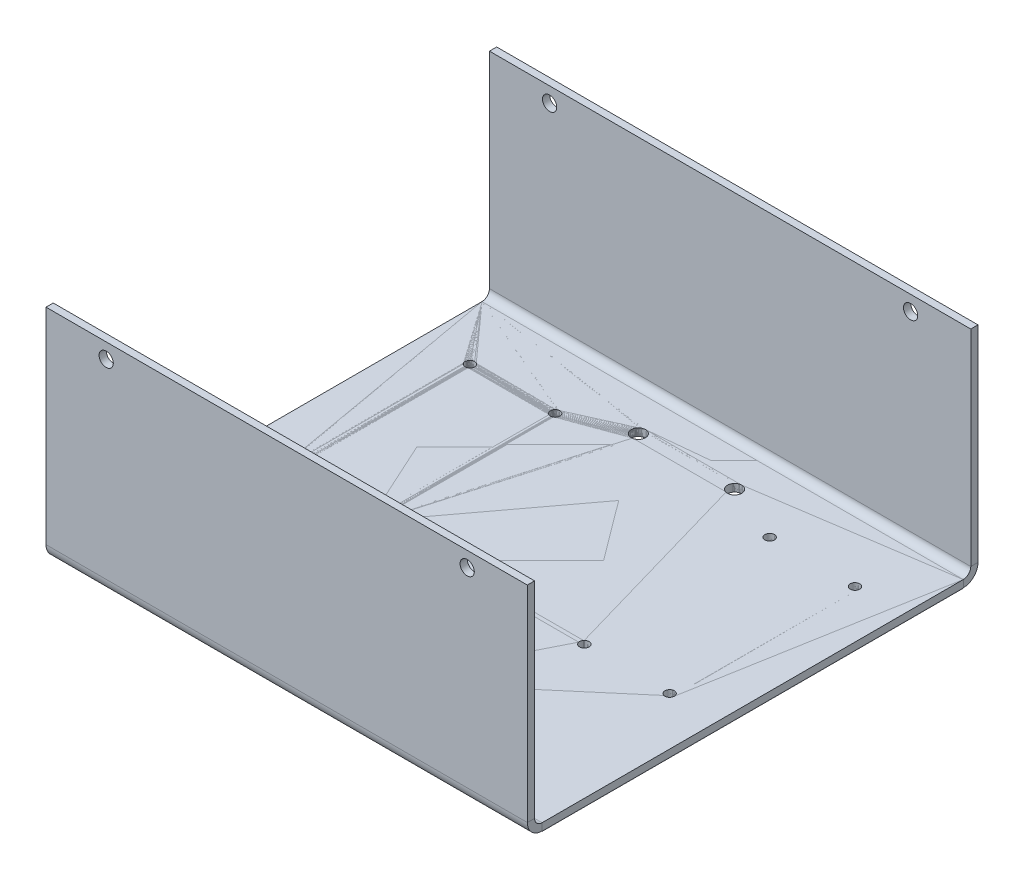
ISO-10303-21;
HEADER;
FILE_DESCRIPTION(('STEP AP214'),'2;1');
FILE_NAME('part.step','',(''),(''),'','','');
FILE_SCHEMA(('AUTOMOTIVE_DESIGN { 1 0 10303 214 1 1 1 1 }'));
ENDSEC;
DATA;
#1=APPLICATION_CONTEXT('core data for automotive mechanical design processes');
#2=APPLICATION_PROTOCOL_DEFINITION('international standard','automotive_design',2000,#1);
#3=PRODUCT_CONTEXT('',#1,'mechanical');
#4=PRODUCT('Part','Part','',(#3));
#5=PRODUCT_RELATED_PRODUCT_CATEGORY('part','',(#4));
#6=PRODUCT_DEFINITION_FORMATION('','',#4);
#7=PRODUCT_DEFINITION_CONTEXT('part definition',#1,'design');
#8=PRODUCT_DEFINITION('design','',#6,#7);
#9=PRODUCT_DEFINITION_SHAPE('','',#8);
#10=(LENGTH_UNIT() NAMED_UNIT(*) SI_UNIT(.MILLI.,.METRE.));
#11=(NAMED_UNIT(*) PLANE_ANGLE_UNIT() SI_UNIT($,.RADIAN.));
#12=(NAMED_UNIT(*) SI_UNIT($,.STERADIAN.) SOLID_ANGLE_UNIT());
#13=UNCERTAINTY_MEASURE_WITH_UNIT(LENGTH_MEASURE(1.E-05),#10,'distance_accuracy_value','');
#14=(GEOMETRIC_REPRESENTATION_CONTEXT(3) GLOBAL_UNCERTAINTY_ASSIGNED_CONTEXT((#13)) GLOBAL_UNIT_ASSIGNED_CONTEXT((#10,
#11,#12)) REPRESENTATION_CONTEXT('',''));
#15=CARTESIAN_POINT('',(0.,0.,0.));
#16=DIRECTION('',(0.,0.,1.));
#17=DIRECTION('',(1.,0.,0.));
#18=AXIS2_PLACEMENT_3D('',#15,#16,#17);
#19=CARTESIAN_POINT('',(103.823636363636,1.5875,-80.01));
#20=DIRECTION('',(1.,0.,0.));
#21=DIRECTION('',(0.,0.,-1.));
#22=AXIS2_PLACEMENT_3D('',#19,#20,#21);
#23=PLANE('',#22);
#24=DIRECTION('',(0.,1.,0.));
#25=VECTOR('',#24,1.);
#26=CARTESIAN_POINT('',(103.823636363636,1.5875,8.89000000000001));
#27=LINE('',#26,#25);
#28=CARTESIAN_POINT('',(103.823636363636,0.0634999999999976,8.89000000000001));
#29=VERTEX_POINT('',#28);
#30=CARTESIAN_POINT('',(103.823636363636,1.5875,8.89000000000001));
#31=VERTEX_POINT('',#30);
#32=EDGE_CURVE('E14',#29,#31,#27,.T.);
#33=ORIENTED_EDGE('',*,*,#32,.F.);
#34=DIRECTION('',(0.,0.,1.));
#35=VECTOR('',#34,1.);
#36=CARTESIAN_POINT('',(103.823636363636,0.0635,0.));
#37=LINE('',#36,#35);
#38=CARTESIAN_POINT('',(103.823636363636,0.0635,-80.01));
#39=VERTEX_POINT('',#38);
#40=EDGE_CURVE('E126',#29,#39,#37,.F.);
#41=ORIENTED_EDGE('',*,*,#40,.T.);
#42=DIRECTION('',(0.,1.,0.));
#43=VECTOR('',#42,1.);
#44=CARTESIAN_POINT('',(103.823636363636,1.5875,-80.01));
#45=LINE('',#44,#43);
#46=CARTESIAN_POINT('',(103.823636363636,1.5875,-80.01));
#47=VERTEX_POINT('',#46);
#48=EDGE_CURVE('E106',#39,#47,#45,.T.);
#49=ORIENTED_EDGE('',*,*,#48,.T.);
#50=DIRECTION('',(0.,0.,-1.));
#51=VECTOR('',#50,1.);
#52=CARTESIAN_POINT('',(103.823636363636,1.5875,-80.01));
#53=LINE('',#52,#51);
#54=EDGE_CURVE('E156',#31,#47,#53,.T.);
#55=ORIENTED_EDGE('',*,*,#54,.F.);
#56=EDGE_LOOP('',(#33,#41,#49,#55));
#57=FACE_BOUND('',#56,.T.);
#58=ADVANCED_FACE('F96',(#57),#23,.T.);
#59=CARTESIAN_POINT('',(2.22363636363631,1.5875,-80.01));
#60=DIRECTION('',(-1.,0.,0.));
#61=DIRECTION('',(0.,0.,1.));
#62=AXIS2_PLACEMENT_3D('',#59,#60,#61);
#63=PLANE('',#62);
#64=DIRECTION('',(0.,1.,0.));
#65=VECTOR('',#64,1.);
#66=CARTESIAN_POINT('',(2.22363636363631,1.5875,-80.01));
#67=LINE('',#66,#65);
#68=CARTESIAN_POINT('',(2.22363636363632,0.0634999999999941,-80.01));
#69=VERTEX_POINT('',#68);
#70=CARTESIAN_POINT('',(2.22363636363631,1.5875,-80.01));
#71=VERTEX_POINT('',#70);
#72=EDGE_CURVE('E269',#69,#71,#67,.T.);
#73=ORIENTED_EDGE('',*,*,#72,.F.);
#74=DIRECTION('',(0.,0.,1.));
#75=VECTOR('',#74,1.);
#76=CARTESIAN_POINT('',(2.22363636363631,0.0635,0.));
#77=LINE('',#76,#75);
#78=CARTESIAN_POINT('',(2.22363636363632,0.0635,8.89000000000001));
#79=VERTEX_POINT('',#78);
#80=EDGE_CURVE('E245',#69,#79,#77,.T.);
#81=ORIENTED_EDGE('',*,*,#80,.T.);
#82=DIRECTION('',(0.,1.,0.));
#83=VECTOR('',#82,1.);
#84=CARTESIAN_POINT('',(2.22363636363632,1.5875,8.89000000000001));
#85=LINE('',#84,#83);
#86=CARTESIAN_POINT('',(2.22363636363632,1.5875,8.89000000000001));
#87=VERTEX_POINT('',#86);
#88=EDGE_CURVE('E100',#79,#87,#85,.T.);
#89=ORIENTED_EDGE('',*,*,#88,.T.);
#90=DIRECTION('',(0.,0.,1.));
#91=VECTOR('',#90,1.);
#92=CARTESIAN_POINT('',(2.22363636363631,1.5875,-80.01));
#93=LINE('',#92,#91);
#94=EDGE_CURVE('E114',#71,#87,#93,.T.);
#95=ORIENTED_EDGE('',*,*,#94,.F.);
#96=EDGE_LOOP('',(#73,#81,#89,#95));
#97=FACE_BOUND('',#96,.T.);
#98=ADVANCED_FACE('F277',(#97),#63,.T.);
#99=CARTESIAN_POINT('',(30.3836363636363,1.5875,-67.31));
#100=DIRECTION('',(0.,1.,0.));
#101=DIRECTION('',(0.,0.,1.));
#102=AXIS2_PLACEMENT_3D('',#99,#100,#101);
#103=CYLINDRICAL_SURFACE('',#102,0.999999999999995);
#104=CARTESIAN_POINT('',(30.3836363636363,1.5875,-67.31));
#105=DIRECTION('',(0.,1.,0.));
#106=DIRECTION('',(0.,0.,-1.));
#107=AXIS2_PLACEMENT_3D('',#104,#105,#106);
#108=CIRCLE('',#107,0.999999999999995);
#109=CARTESIAN_POINT('',(30.3836363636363,1.5875,-68.31));
#110=VERTEX_POINT('',#109);
#111=EDGE_CURVE('E187',#110,#110,#108,.T.);
#112=ORIENTED_EDGE('',*,*,#111,.T.);
#113=EDGE_LOOP('',(#112));
#114=FACE_BOUND('',#113,.T.);
#115=CARTESIAN_POINT('',(30.3836363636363,0.0635,-67.31));
#116=DIRECTION('',(0.,1.,0.));
#117=DIRECTION('',(0.,0.,1.));
#118=AXIS2_PLACEMENT_3D('',#115,#116,#117);
#119=CIRCLE('',#118,0.999999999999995);
#120=CARTESIAN_POINT('',(30.3836363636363,0.0635,-66.31));
#121=VERTEX_POINT('',#120);
#122=EDGE_CURVE('E226',#121,#121,#119,.T.);
#123=ORIENTED_EDGE('',*,*,#122,.F.);
#124=EDGE_LOOP('',(#123));
#125=FACE_BOUND('',#124,.T.);
#126=ADVANCED_FACE('F475',(#114,#125),#103,.F.);
#127=CARTESIAN_POINT('',(30.3836363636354,1.5875,-28.194));
#128=DIRECTION('',(0.,1.,0.));
#129=DIRECTION('',(0.,0.,1.));
#130=AXIS2_PLACEMENT_3D('',#127,#128,#129);
#131=CYLINDRICAL_SURFACE('',#130,0.999999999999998);
#132=CARTESIAN_POINT('',(30.3836363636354,1.5875,-28.194));
#133=DIRECTION('',(0.,1.,0.));
#134=DIRECTION('',(0.,0.,-1.));
#135=AXIS2_PLACEMENT_3D('',#132,#133,#134);
#136=CIRCLE('',#135,0.999999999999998);
#137=CARTESIAN_POINT('',(30.3836363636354,1.5875,-29.194));
#138=VERTEX_POINT('',#137);
#139=EDGE_CURVE('E190',#138,#138,#136,.T.);
#140=ORIENTED_EDGE('',*,*,#139,.T.);
#141=EDGE_LOOP('',(#140));
#142=FACE_BOUND('',#141,.T.);
#143=CARTESIAN_POINT('',(30.3836363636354,0.0635,-28.194));
#144=DIRECTION('',(0.,1.,0.));
#145=DIRECTION('',(0.,0.,1.));
#146=AXIS2_PLACEMENT_3D('',#143,#144,#145);
#147=CIRCLE('',#146,0.999999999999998);
#148=CARTESIAN_POINT('',(30.3836363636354,0.0635,-27.194));
#149=VERTEX_POINT('',#148);
#150=EDGE_CURVE('E229',#149,#149,#147,.T.);
#151=ORIENTED_EDGE('',*,*,#150,.F.);
#152=EDGE_LOOP('',(#151));
#153=FACE_BOUND('',#152,.T.);
#154=ADVANCED_FACE('F861',(#142,#153),#131,.F.);
#155=CARTESIAN_POINT('',(75.6636363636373,1.5875,-28.194));
#156=DIRECTION('',(0.,1.,0.));
#157=DIRECTION('',(0.,0.,1.));
#158=AXIS2_PLACEMENT_3D('',#155,#156,#157);
#159=CYLINDRICAL_SURFACE('',#158,0.999999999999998);
#160=CARTESIAN_POINT('',(75.6636363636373,1.5875,-28.194));
#161=DIRECTION('',(0.,1.,0.));
#162=DIRECTION('',(0.,0.,1.));
#163=AXIS2_PLACEMENT_3D('',#160,#161,#162);
#164=CIRCLE('',#163,0.999999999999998);
#165=CARTESIAN_POINT('',(75.6636363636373,1.5875,-27.194));
#166=VERTEX_POINT('',#165);
#167=EDGE_CURVE('E194',#166,#166,#164,.T.);
#168=ORIENTED_EDGE('',*,*,#167,.T.);
#169=EDGE_LOOP('',(#168));
#170=FACE_BOUND('',#169,.T.);
#171=CARTESIAN_POINT('',(75.6636363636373,0.0635,-28.194));
#172=DIRECTION('',(0.,1.,0.));
#173=DIRECTION('',(0.,0.,1.));
#174=AXIS2_PLACEMENT_3D('',#171,#172,#173);
#175=CIRCLE('',#174,0.999999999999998);
#176=CARTESIAN_POINT('',(75.6636363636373,0.0635,-27.194));
#177=VERTEX_POINT('',#176);
#178=EDGE_CURVE('E233',#177,#177,#175,.T.);
#179=ORIENTED_EDGE('',*,*,#178,.F.);
#180=EDGE_LOOP('',(#179));
#181=FACE_BOUND('',#180,.T.);
#182=ADVANCED_FACE('F851',(#170,#181),#159,.F.);
#183=CARTESIAN_POINT('',(93.6636363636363,1.5875,-67.31));
#184=DIRECTION('',(0.,1.,0.));
#185=DIRECTION('',(0.,0.,1.));
#186=AXIS2_PLACEMENT_3D('',#183,#184,#185);
#187=CYLINDRICAL_SURFACE('',#186,0.999999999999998);
#188=CARTESIAN_POINT('',(93.6636363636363,1.5875,-67.31));
#189=DIRECTION('',(0.,1.,0.));
#190=DIRECTION('',(0.,0.,1.));
#191=AXIS2_PLACEMENT_3D('',#188,#189,#190);
#192=CIRCLE('',#191,0.999999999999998);
#193=CARTESIAN_POINT('',(93.6636363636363,1.5875,-66.31));
#194=VERTEX_POINT('',#193);
#195=EDGE_CURVE('E197',#194,#194,#192,.T.);
#196=ORIENTED_EDGE('',*,*,#195,.T.);
#197=EDGE_LOOP('',(#196));
#198=FACE_BOUND('',#197,.T.);
#199=CARTESIAN_POINT('',(93.6636363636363,0.0635,-67.31));
#200=DIRECTION('',(0.,1.,0.));
#201=DIRECTION('',(0.,0.,1.));
#202=AXIS2_PLACEMENT_3D('',#199,#200,#201);
#203=CIRCLE('',#202,0.999999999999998);
#204=CARTESIAN_POINT('',(93.6636363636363,0.0635,-66.31));
#205=VERTEX_POINT('',#204);
#206=EDGE_CURVE('E236',#205,#205,#203,.T.);
#207=ORIENTED_EDGE('',*,*,#206,.F.);
#208=EDGE_LOOP('',(#207));
#209=FACE_BOUND('',#208,.T.);
#210=ADVANCED_FACE('F841',(#198,#209),#187,.F.);
#211=CARTESIAN_POINT('',(75.6636363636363,1.5875,-67.31));
#212=DIRECTION('',(0.,1.,0.));
#213=DIRECTION('',(0.,0.,1.));
#214=AXIS2_PLACEMENT_3D('',#211,#212,#213);
#215=CYLINDRICAL_SURFACE('',#214,0.999999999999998);
#216=CARTESIAN_POINT('',(75.6636363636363,1.5875,-67.31));
#217=DIRECTION('',(0.,1.,0.));
#218=DIRECTION('',(0.,0.,1.));
#219=AXIS2_PLACEMENT_3D('',#216,#217,#218);
#220=CIRCLE('',#219,0.999999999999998);
#221=CARTESIAN_POINT('',(75.6636363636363,1.5875,-66.31));
#222=VERTEX_POINT('',#221);
#223=EDGE_CURVE('E200',#222,#222,#220,.T.);
#224=ORIENTED_EDGE('',*,*,#223,.T.);
#225=EDGE_LOOP('',(#224));
#226=FACE_BOUND('',#225,.T.);
#227=CARTESIAN_POINT('',(75.6636363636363,0.0635,-67.31));
#228=DIRECTION('',(0.,1.,0.));
#229=DIRECTION('',(0.,0.,1.));
#230=AXIS2_PLACEMENT_3D('',#227,#228,#229);
#231=CIRCLE('',#230,0.999999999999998);
#232=CARTESIAN_POINT('',(75.6636363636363,0.0635,-66.31));
#233=VERTEX_POINT('',#232);
#234=EDGE_CURVE('E239',#233,#233,#231,.T.);
#235=ORIENTED_EDGE('',*,*,#234,.F.);
#236=EDGE_LOOP('',(#235));
#237=FACE_BOUND('',#236,.T.);
#238=ADVANCED_FACE('F832',(#226,#237),#215,.F.);
#239=CARTESIAN_POINT('',(63.1836363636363,1.5875,-72.39));
#240=DIRECTION('',(0.,1.,0.));
#241=DIRECTION('',(0.,0.,1.));
#242=AXIS2_PLACEMENT_3D('',#239,#240,#241);
#243=CYLINDRICAL_SURFACE('',#242,1.5);
#244=CARTESIAN_POINT('',(63.1836363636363,1.5875,-72.39));
#245=DIRECTION('',(0.,1.,0.));
#246=DIRECTION('',(0.,0.,1.));
#247=AXIS2_PLACEMENT_3D('',#244,#245,#246);
#248=CIRCLE('',#247,1.5);
#249=CARTESIAN_POINT('',(63.1836363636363,1.5875,-70.89));
#250=VERTEX_POINT('',#249);
#251=EDGE_CURVE('E203',#250,#250,#248,.T.);
#252=ORIENTED_EDGE('',*,*,#251,.T.);
#253=EDGE_LOOP('',(#252));
#254=FACE_BOUND('',#253,.T.);
#255=CARTESIAN_POINT('',(63.1836363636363,0.0635,-72.39));
#256=DIRECTION('',(0.,1.,0.));
#257=DIRECTION('',(0.,0.,1.));
#258=AXIS2_PLACEMENT_3D('',#255,#256,#257);
#259=CIRCLE('',#258,1.5);
#260=CARTESIAN_POINT('',(63.1836363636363,0.0635,-70.89));
#261=VERTEX_POINT('',#260);
#262=EDGE_CURVE('E242',#261,#261,#259,.T.);
#263=ORIENTED_EDGE('',*,*,#262,.F.);
#264=EDGE_LOOP('',(#263));
#265=FACE_BOUND('',#264,.T.);
#266=ADVANCED_FACE('F483',(#254,#265),#243,.F.);
#267=CARTESIAN_POINT('',(63.183636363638,1.5875,-2.54));
#268=DIRECTION('',(0.,1.,0.));
#269=DIRECTION('',(0.,0.,1.));
#270=AXIS2_PLACEMENT_3D('',#267,#268,#269);
#271=CYLINDRICAL_SURFACE('',#270,1.5);
#272=CARTESIAN_POINT('',(63.183636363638,1.5875,-2.54));
#273=DIRECTION('',(0.,1.,0.));
#274=DIRECTION('',(0.,0.,1.));
#275=AXIS2_PLACEMENT_3D('',#272,#273,#274);
#276=CIRCLE('',#275,1.5);
#277=CARTESIAN_POINT('',(63.183636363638,1.5875,-1.04));
#278=VERTEX_POINT('',#277);
#279=EDGE_CURVE('E208',#278,#278,#276,.T.);
#280=ORIENTED_EDGE('',*,*,#279,.T.);
#281=EDGE_LOOP('',(#280));
#282=FACE_BOUND('',#281,.T.);
#283=CARTESIAN_POINT('',(63.183636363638,0.0635,-2.54));
#284=DIRECTION('',(0.,1.,0.));
#285=DIRECTION('',(0.,0.,1.));
#286=AXIS2_PLACEMENT_3D('',#283,#284,#285);
#287=CIRCLE('',#286,1.5);
#288=CARTESIAN_POINT('',(63.183636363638,0.0635,-1.04));
#289=VERTEX_POINT('',#288);
#290=EDGE_CURVE('E250',#289,#289,#287,.T.);
#291=ORIENTED_EDGE('',*,*,#290,.F.);
#292=EDGE_LOOP('',(#291));
#293=FACE_BOUND('',#292,.T.);
#294=ADVANCED_FACE('F479',(#282,#293),#271,.F.);
#295=CARTESIAN_POINT('',(42.8636363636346,1.5875,-2.54));
#296=DIRECTION('',(0.,1.,0.));
#297=DIRECTION('',(0.,0.,1.));
#298=AXIS2_PLACEMENT_3D('',#295,#296,#297);
#299=CYLINDRICAL_SURFACE('',#298,1.5);
#300=CARTESIAN_POINT('',(42.8636363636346,1.5875,-2.54));
#301=DIRECTION('',(0.,1.,0.));
#302=DIRECTION('',(0.,0.,-1.));
#303=AXIS2_PLACEMENT_3D('',#300,#301,#302);
#304=CIRCLE('',#303,1.5);
#305=CARTESIAN_POINT('',(42.8636363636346,1.5875,-4.04));
#306=VERTEX_POINT('',#305);
#307=EDGE_CURVE('E211',#306,#306,#304,.T.);
#308=ORIENTED_EDGE('',*,*,#307,.T.);
#309=EDGE_LOOP('',(#308));
#310=FACE_BOUND('',#309,.T.);
#311=CARTESIAN_POINT('',(42.8636363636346,0.0635,-2.54));
#312=DIRECTION('',(0.,1.,0.));
#313=DIRECTION('',(0.,0.,1.));
#314=AXIS2_PLACEMENT_3D('',#311,#312,#313);
#315=CIRCLE('',#314,1.5);
#316=CARTESIAN_POINT('',(42.8636363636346,0.0635,-1.03999999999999));
#317=VERTEX_POINT('',#316);
#318=EDGE_CURVE('E255',#317,#317,#315,.T.);
#319=ORIENTED_EDGE('',*,*,#318,.F.);
#320=EDGE_LOOP('',(#319));
#321=FACE_BOUND('',#320,.T.);
#322=ADVANCED_FACE('F482',(#310,#321),#299,.F.);
#323=CARTESIAN_POINT('',(93.6636363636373,1.5875,-28.194));
#324=DIRECTION('',(0.,1.,0.));
#325=DIRECTION('',(0.,0.,1.));
#326=AXIS2_PLACEMENT_3D('',#323,#324,#325);
#327=CYLINDRICAL_SURFACE('',#326,0.999999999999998);
#328=CARTESIAN_POINT('',(93.6636363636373,1.5875,-28.194));
#329=DIRECTION('',(0.,1.,0.));
#330=DIRECTION('',(0.,0.,1.));
#331=AXIS2_PLACEMENT_3D('',#328,#329,#330);
#332=CIRCLE('',#331,0.999999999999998);
#333=CARTESIAN_POINT('',(93.6636363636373,1.5875,-27.194));
#334=VERTEX_POINT('',#333);
#335=EDGE_CURVE('E214',#334,#334,#332,.T.);
#336=ORIENTED_EDGE('',*,*,#335,.T.);
#337=EDGE_LOOP('',(#336));
#338=FACE_BOUND('',#337,.T.);
#339=CARTESIAN_POINT('',(93.6636363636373,0.0635,-28.194));
#340=DIRECTION('',(0.,1.,0.));
#341=DIRECTION('',(0.,0.,1.));
#342=AXIS2_PLACEMENT_3D('',#339,#340,#341);
#343=CIRCLE('',#342,0.999999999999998);
#344=CARTESIAN_POINT('',(93.6636363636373,0.0635,-27.194));
#345=VERTEX_POINT('',#344);
#346=EDGE_CURVE('E258',#345,#345,#343,.T.);
#347=ORIENTED_EDGE('',*,*,#346,.F.);
#348=EDGE_LOOP('',(#347));
#349=FACE_BOUND('',#348,.T.);
#350=ADVANCED_FACE('F487',(#338,#349),#327,.F.);
#351=CARTESIAN_POINT('',(12.3836363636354,1.5875,-28.194));
#352=DIRECTION('',(0.,1.,0.));
#353=DIRECTION('',(0.,0.,1.));
#354=AXIS2_PLACEMENT_3D('',#351,#352,#353);
#355=CYLINDRICAL_SURFACE('',#354,1.);
#356=CARTESIAN_POINT('',(12.3836363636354,1.5875,-28.194));
#357=DIRECTION('',(0.,1.,0.));
#358=DIRECTION('',(0.,0.,-1.));
#359=AXIS2_PLACEMENT_3D('',#356,#357,#358);
#360=CIRCLE('',#359,1.);
#361=CARTESIAN_POINT('',(12.3836363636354,1.5875,-29.194));
#362=VERTEX_POINT('',#361);
#363=EDGE_CURVE('E217',#362,#362,#360,.T.);
#364=ORIENTED_EDGE('',*,*,#363,.T.);
#365=EDGE_LOOP('',(#364));
#366=FACE_BOUND('',#365,.T.);
#367=CARTESIAN_POINT('',(12.3836363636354,0.0635,-28.194));
#368=DIRECTION('',(0.,1.,0.));
#369=DIRECTION('',(0.,0.,1.));
#370=AXIS2_PLACEMENT_3D('',#367,#368,#369);
#371=CIRCLE('',#370,1.);
#372=CARTESIAN_POINT('',(12.3836363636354,0.0635,-27.194));
#373=VERTEX_POINT('',#372);
#374=EDGE_CURVE('E261',#373,#373,#371,.T.);
#375=ORIENTED_EDGE('',*,*,#374,.F.);
#376=EDGE_LOOP('',(#375));
#377=FACE_BOUND('',#376,.T.);
#378=ADVANCED_FACE('F468',(#366,#377),#355,.F.);
#379=CARTESIAN_POINT('',(12.3836363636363,1.5875,-67.31));
#380=DIRECTION('',(0.,1.,0.));
#381=DIRECTION('',(0.,0.,1.));
#382=AXIS2_PLACEMENT_3D('',#379,#380,#381);
#383=CYLINDRICAL_SURFACE('',#382,1.);
#384=CARTESIAN_POINT('',(12.3836363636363,1.5875,-67.31));
#385=DIRECTION('',(0.,1.,0.));
#386=DIRECTION('',(0.,0.,-1.));
#387=AXIS2_PLACEMENT_3D('',#384,#385,#386);
#388=CIRCLE('',#387,1.);
#389=CARTESIAN_POINT('',(12.3836363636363,1.5875,-68.31));
#390=VERTEX_POINT('',#389);
#391=EDGE_CURVE('E220',#390,#390,#388,.T.);
#392=ORIENTED_EDGE('',*,*,#391,.T.);
#393=EDGE_LOOP('',(#392));
#394=FACE_BOUND('',#393,.T.);
#395=CARTESIAN_POINT('',(12.3836363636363,0.0635,-67.31));
#396=DIRECTION('',(0.,1.,0.));
#397=DIRECTION('',(0.,0.,1.));
#398=AXIS2_PLACEMENT_3D('',#395,#396,#397);
#399=CIRCLE('',#398,1.);
#400=CARTESIAN_POINT('',(12.3836363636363,0.0635,-66.31));
#401=VERTEX_POINT('',#400);
#402=EDGE_CURVE('E264',#401,#401,#399,.T.);
#403=ORIENTED_EDGE('',*,*,#402,.F.);
#404=EDGE_LOOP('',(#403));
#405=FACE_BOUND('',#404,.T.);
#406=ADVANCED_FACE('F460',(#394,#405),#383,.F.);
#407=CARTESIAN_POINT('',(42.8636363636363,1.5875,-72.39));
#408=DIRECTION('',(0.,1.,0.));
#409=DIRECTION('',(0.,0.,1.));
#410=AXIS2_PLACEMENT_3D('',#407,#408,#409);
#411=CYLINDRICAL_SURFACE('',#410,1.5);
#412=CARTESIAN_POINT('',(42.8636363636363,1.5875,-72.39));
#413=DIRECTION('',(0.,1.,0.));
#414=DIRECTION('',(0.,0.,-1.));
#415=AXIS2_PLACEMENT_3D('',#412,#413,#414);
#416=CIRCLE('',#415,1.5);
#417=CARTESIAN_POINT('',(42.8636363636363,1.5875,-73.89));
#418=VERTEX_POINT('',#417);
#419=EDGE_CURVE('E223',#418,#418,#416,.T.);
#420=ORIENTED_EDGE('',*,*,#419,.T.);
#421=EDGE_LOOP('',(#420));
#422=FACE_BOUND('',#421,.T.);
#423=CARTESIAN_POINT('',(42.8636363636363,0.0635,-72.39));
#424=DIRECTION('',(0.,1.,0.));
#425=DIRECTION('',(0.,0.,1.));
#426=AXIS2_PLACEMENT_3D('',#423,#424,#425);
#427=CIRCLE('',#426,1.5);
#428=CARTESIAN_POINT('',(42.8636363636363,0.0635,-70.89));
#429=VERTEX_POINT('',#428);
#430=EDGE_CURVE('E191',#429,#429,#427,.T.);
#431=ORIENTED_EDGE('',*,*,#430,.F.);
#432=EDGE_LOOP('',(#431));
#433=FACE_BOUND('',#432,.T.);
#434=ADVANCED_FACE('F98',(#422,#433),#411,.F.);
#435=CARTESIAN_POINT('',(0.,1.5875,0.));
#436=DIRECTION('',(0.,1.,0.));
#437=DIRECTION('',(0.,0.,1.));
#438=AXIS2_PLACEMENT_3D('',#435,#436,#437);
#439=PLANE('',#438);
#440=ORIENTED_EDGE('',*,*,#111,.F.);
#441=EDGE_LOOP('',(#440));
#442=FACE_BOUND('',#441,.T.);
#443=ORIENTED_EDGE('',*,*,#139,.F.);
#444=EDGE_LOOP('',(#443));
#445=FACE_BOUND('',#444,.T.);
#446=ORIENTED_EDGE('',*,*,#167,.F.);
#447=EDGE_LOOP('',(#446));
#448=FACE_BOUND('',#447,.T.);
#449=ORIENTED_EDGE('',*,*,#195,.F.);
#450=EDGE_LOOP('',(#449));
#451=FACE_BOUND('',#450,.T.);
#452=ORIENTED_EDGE('',*,*,#223,.F.);
#453=EDGE_LOOP('',(#452));
#454=FACE_BOUND('',#453,.T.);
#455=ORIENTED_EDGE('',*,*,#251,.F.);
#456=EDGE_LOOP('',(#455));
#457=FACE_BOUND('',#456,.T.);
#458=ORIENTED_EDGE('',*,*,#94,.T.);
#459=DIRECTION('',(1.,0.,0.));
#460=VECTOR('',#459,1.);
#461=CARTESIAN_POINT('',(2.22363636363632,1.5875,8.89000000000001));
#462=LINE('',#461,#460);
#463=EDGE_CURVE('E152',#87,#31,#462,.T.);
#464=ORIENTED_EDGE('',*,*,#463,.T.);
#465=ORIENTED_EDGE('',*,*,#54,.T.);
#466=DIRECTION('',(-1.,0.,0.));
#467=VECTOR('',#466,1.);
#468=CARTESIAN_POINT('',(2.22363636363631,1.5875,-80.01));
#469=LINE('',#468,#467);
#470=EDGE_CURVE('E164',#47,#71,#469,.T.);
#471=ORIENTED_EDGE('',*,*,#470,.T.);
#472=EDGE_LOOP('',(#458,#464,#465,#471));
#473=FACE_BOUND('',#472,.T.);
#474=ORIENTED_EDGE('',*,*,#279,.F.);
#475=EDGE_LOOP('',(#474));
#476=FACE_BOUND('',#475,.T.);
#477=ORIENTED_EDGE('',*,*,#307,.F.);
#478=EDGE_LOOP('',(#477));
#479=FACE_BOUND('',#478,.T.);
#480=ORIENTED_EDGE('',*,*,#335,.F.);
#481=EDGE_LOOP('',(#480));
#482=FACE_BOUND('',#481,.T.);
#483=ORIENTED_EDGE('',*,*,#363,.F.);
#484=EDGE_LOOP('',(#483));
#485=FACE_BOUND('',#484,.T.);
#486=ORIENTED_EDGE('',*,*,#391,.F.);
#487=EDGE_LOOP('',(#486));
#488=FACE_BOUND('',#487,.T.);
#489=ORIENTED_EDGE('',*,*,#419,.F.);
#490=EDGE_LOOP('',(#489));
#491=FACE_BOUND('',#490,.T.);
#492=ADVANCED_FACE('F154',(#442,#445,#448,#451,#454,#457,#473,#476,#479,#482,#485,#488,#491),
#439,.T.);
#493=CARTESIAN_POINT('',(0.,0.0635,0.));
#494=DIRECTION('',(0.,1.,0.));
#495=DIRECTION('',(0.,0.,1.));
#496=AXIS2_PLACEMENT_3D('',#493,#494,#495);
#497=PLANE('',#496);
#498=ORIENTED_EDGE('',*,*,#122,.T.);
#499=EDGE_LOOP('',(#498));
#500=FACE_BOUND('',#499,.T.);
#501=ORIENTED_EDGE('',*,*,#150,.T.);
#502=EDGE_LOOP('',(#501));
#503=FACE_BOUND('',#502,.T.);
#504=ORIENTED_EDGE('',*,*,#178,.T.);
#505=EDGE_LOOP('',(#504));
#506=FACE_BOUND('',#505,.T.);
#507=ORIENTED_EDGE('',*,*,#206,.T.);
#508=EDGE_LOOP('',(#507));
#509=FACE_BOUND('',#508,.T.);
#510=ORIENTED_EDGE('',*,*,#234,.T.);
#511=EDGE_LOOP('',(#510));
#512=FACE_BOUND('',#511,.T.);
#513=ORIENTED_EDGE('',*,*,#262,.T.);
#514=EDGE_LOOP('',(#513));
#515=FACE_BOUND('',#514,.T.);
#516=ORIENTED_EDGE('',*,*,#80,.F.);
#517=DIRECTION('',(1.,0.,0.));
#518=VECTOR('',#517,1.);
#519=CARTESIAN_POINT('',(0.,0.0635,-80.01));
#520=LINE('',#519,#518);
#521=EDGE_CURVE('E247',#39,#69,#520,.F.);
#522=ORIENTED_EDGE('',*,*,#521,.F.);
#523=ORIENTED_EDGE('',*,*,#40,.F.);
#524=DIRECTION('',(1.,0.,0.));
#525=VECTOR('',#524,1.);
#526=CARTESIAN_POINT('',(0.,0.0635,8.89000000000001));
#527=LINE('',#526,#525);
#528=EDGE_CURVE('E134',#79,#29,#527,.T.);
#529=ORIENTED_EDGE('',*,*,#528,.F.);
#530=EDGE_LOOP('',(#516,#522,#523,#529));
#531=FACE_BOUND('',#530,.T.);
#532=ORIENTED_EDGE('',*,*,#290,.T.);
#533=EDGE_LOOP('',(#532));
#534=FACE_BOUND('',#533,.T.);
#535=ORIENTED_EDGE('',*,*,#318,.T.);
#536=EDGE_LOOP('',(#535));
#537=FACE_BOUND('',#536,.T.);
#538=ORIENTED_EDGE('',*,*,#346,.T.);
#539=EDGE_LOOP('',(#538));
#540=FACE_BOUND('',#539,.T.);
#541=ORIENTED_EDGE('',*,*,#374,.T.);
#542=EDGE_LOOP('',(#541));
#543=FACE_BOUND('',#542,.T.);
#544=ORIENTED_EDGE('',*,*,#402,.T.);
#545=EDGE_LOOP('',(#544));
#546=FACE_BOUND('',#545,.T.);
#547=ORIENTED_EDGE('',*,*,#430,.T.);
#548=EDGE_LOOP('',(#547));
#549=FACE_BOUND('',#548,.T.);
#550=ADVANCED_FACE('F442',(#500,#503,#506,#509,#512,#515,#531,#534,#537,#540,#543,#546,#549),
#497,.F.);
#551=CARTESIAN_POINT('',(2.22363636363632,3.17499999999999,8.89000000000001));
#552=DIRECTION('',(-1.,0.,0.));
#553=DIRECTION('',(0.,0.,1.));
#554=AXIS2_PLACEMENT_3D('',#551,#552,#553);
#555=PLANE('',#554);
#556=DIRECTION('',(0.,0.,-1.));
#557=VECTOR('',#556,1.);
#558=CARTESIAN_POINT('',(2.22363636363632,3.17499999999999,12.0015));
#559=LINE('',#558,#557);
#560=CARTESIAN_POINT('',(2.22363636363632,3.17499999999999,10.4775));
#561=VERTEX_POINT('',#560);
#562=CARTESIAN_POINT('',(2.22363636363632,3.17499999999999,12.0015));
#563=VERTEX_POINT('',#562);
#564=EDGE_CURVE('E289',#561,#563,#559,.F.);
#565=ORIENTED_EDGE('',*,*,#564,.F.);
#566=CARTESIAN_POINT('',(2.22363636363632,3.17499999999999,8.89000000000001));
#567=DIRECTION('',(1.,0.,0.));
#568=DIRECTION('',(0.,0.,-1.));
#569=AXIS2_PLACEMENT_3D('',#566,#567,#568);
#570=CIRCLE('',#569,1.5875);
#571=EDGE_CURVE('E178',#87,#561,#570,.F.);
#572=ORIENTED_EDGE('',*,*,#571,.F.);
#573=ORIENTED_EDGE('',*,*,#88,.F.);
#574=CARTESIAN_POINT('',(2.22363636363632,3.17499999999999,8.89000000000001));
#575=DIRECTION('',(1.,0.,0.));
#576=DIRECTION('',(0.,0.,-1.));
#577=AXIS2_PLACEMENT_3D('',#574,#575,#576);
#578=CIRCLE('',#577,3.1115);
#579=EDGE_CURVE('E230',#79,#563,#578,.F.);
#580=ORIENTED_EDGE('',*,*,#579,.T.);
#581=EDGE_LOOP('',(#565,#572,#573,#580));
#582=FACE_BOUND('',#581,.T.);
#583=ADVANCED_FACE('F281',(#582),#555,.T.);
#584=CARTESIAN_POINT('',(103.823636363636,3.17499999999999,8.89000000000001));
#585=DIRECTION('',(-1.,0.,0.));
#586=DIRECTION('',(0.,0.,1.));
#587=AXIS2_PLACEMENT_3D('',#584,#585,#586);
#588=PLANE('',#587);
#589=CARTESIAN_POINT('',(103.823636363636,3.17499999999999,8.89000000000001));
#590=DIRECTION('',(1.,0.,0.));
#591=DIRECTION('',(0.,0.,-1.));
#592=AXIS2_PLACEMENT_3D('',#589,#590,#591);
#593=CIRCLE('',#592,1.5875);
#594=CARTESIAN_POINT('',(103.823636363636,3.17499999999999,10.4775));
#595=VERTEX_POINT('',#594);
#596=EDGE_CURVE('E171',#595,#31,#593,.T.);
#597=ORIENTED_EDGE('',*,*,#596,.F.);
#598=DIRECTION('',(0.,0.,-1.));
#599=VECTOR('',#598,1.);
#600=CARTESIAN_POINT('',(103.823636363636,3.17499999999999,10.4775));
#601=LINE('',#600,#599);
#602=CARTESIAN_POINT('',(103.823636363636,3.17499999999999,12.0015));
#603=VERTEX_POINT('',#602);
#604=EDGE_CURVE('E293',#595,#603,#601,.F.);
#605=ORIENTED_EDGE('',*,*,#604,.T.);
#606=CARTESIAN_POINT('',(103.823636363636,3.17499999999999,8.89000000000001));
#607=DIRECTION('',(1.,0.,0.));
#608=DIRECTION('',(0.,0.,-1.));
#609=AXIS2_PLACEMENT_3D('',#606,#607,#608);
#610=CIRCLE('',#609,3.1115);
#611=EDGE_CURVE('E174',#603,#29,#610,.T.);
#612=ORIENTED_EDGE('',*,*,#611,.T.);
#613=ORIENTED_EDGE('',*,*,#32,.T.);
#614=EDGE_LOOP('',(#597,#605,#612,#613));
#615=FACE_BOUND('',#614,.T.);
#616=ADVANCED_FACE('F169',(#615),#588,.F.);
#617=CARTESIAN_POINT('',(103.823636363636,3.17499999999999,8.89000000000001));
#618=DIRECTION('',(1.,0.,0.));
#619=DIRECTION('',(0.,0.,1.));
#620=AXIS2_PLACEMENT_3D('',#617,#618,#619);
#621=CYLINDRICAL_SURFACE('',#620,3.1115);
#622=ORIENTED_EDGE('',*,*,#528,.T.);
#623=ORIENTED_EDGE('',*,*,#611,.F.);
#624=DIRECTION('',(1.,0.,0.));
#625=VECTOR('',#624,1.);
#626=CARTESIAN_POINT('',(2.22363636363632,3.17499999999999,12.0015));
#627=LINE('',#626,#625);
#628=EDGE_CURVE('E286',#603,#563,#627,.F.);
#629=ORIENTED_EDGE('',*,*,#628,.T.);
#630=ORIENTED_EDGE('',*,*,#579,.F.);
#631=EDGE_LOOP('',(#622,#623,#629,#630));
#632=FACE_BOUND('',#631,.T.);
#633=ADVANCED_FACE('F284',(#632),#621,.T.);
#634=CARTESIAN_POINT('',(103.823636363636,3.17499999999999,8.89000000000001));
#635=DIRECTION('',(1.,0.,0.));
#636=DIRECTION('',(0.,0.,1.));
#637=AXIS2_PLACEMENT_3D('',#634,#635,#636);
#638=CYLINDRICAL_SURFACE('',#637,1.5875);
#639=ORIENTED_EDGE('',*,*,#463,.F.);
#640=ORIENTED_EDGE('',*,*,#571,.T.);
#641=DIRECTION('',(1.,0.,0.));
#642=VECTOR('',#641,1.);
#643=CARTESIAN_POINT('',(2.22363636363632,3.17499999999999,10.4775));
#644=LINE('',#643,#642);
#645=EDGE_CURVE('E177',#561,#595,#644,.T.);
#646=ORIENTED_EDGE('',*,*,#645,.T.);
#647=ORIENTED_EDGE('',*,*,#596,.T.);
#648=EDGE_LOOP('',(#639,#640,#646,#647));
#649=FACE_BOUND('',#648,.T.);
#650=ADVANCED_FACE('F175',(#649),#638,.F.);
#651=CARTESIAN_POINT('',(0.,0.,12.0015));
#652=DIRECTION('',(0.,0.,-1.));
#653=DIRECTION('',(-1.,0.,0.));
#654=AXIS2_PLACEMENT_3D('',#651,#652,#653);
#655=PLANE('',#654);
#656=CARTESIAN_POINT('',(91.1236363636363,43.4125,12.0015));
#657=DIRECTION('',(0.,0.,-1.));
#658=DIRECTION('',(-1.,0.,0.));
#659=AXIS2_PLACEMENT_3D('',#656,#657,#658);
#660=CIRCLE('',#659,1.5);
#661=CARTESIAN_POINT('',(89.6236363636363,43.4125,12.0015));
#662=VERTEX_POINT('',#661);
#663=EDGE_CURVE('E299',#662,#662,#660,.F.);
#664=ORIENTED_EDGE('',*,*,#663,.F.);
#665=EDGE_LOOP('',(#664));
#666=FACE_BOUND('',#665,.T.);
#667=CARTESIAN_POINT('',(14.9236363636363,43.4125,12.0015));
#668=DIRECTION('',(0.,0.,-1.));
#669=DIRECTION('',(-1.,0.,0.));
#670=AXIS2_PLACEMENT_3D('',#667,#668,#669);
#671=CIRCLE('',#670,1.5);
#672=CARTESIAN_POINT('',(13.4236363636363,43.4125,12.0015));
#673=VERTEX_POINT('',#672);
#674=EDGE_CURVE('E305',#673,#673,#671,.F.);
#675=ORIENTED_EDGE('',*,*,#674,.F.);
#676=EDGE_LOOP('',(#675));
#677=FACE_BOUND('',#676,.T.);
#678=ORIENTED_EDGE('',*,*,#628,.F.);
#679=DIRECTION('',(0.,1.,0.));
#680=VECTOR('',#679,1.);
#681=CARTESIAN_POINT('',(103.823636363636,0.,12.0015));
#682=LINE('',#681,#680);
#683=CARTESIAN_POINT('',(103.823636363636,46.5875,12.0015));
#684=VERTEX_POINT('',#683);
#685=EDGE_CURVE('E320',#603,#684,#682,.T.);
#686=ORIENTED_EDGE('',*,*,#685,.T.);
#687=DIRECTION('',(-1.,0.,0.));
#688=VECTOR('',#687,1.);
#689=CARTESIAN_POINT('',(0.,46.5875,12.0015));
#690=LINE('',#689,#688);
#691=CARTESIAN_POINT('',(2.22363636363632,46.5875,12.0015));
#692=VERTEX_POINT('',#691);
#693=EDGE_CURVE('E323',#684,#692,#690,.T.);
#694=ORIENTED_EDGE('',*,*,#693,.T.);
#695=DIRECTION('',(0.,-1.,0.));
#696=VECTOR('',#695,1.);
#697=CARTESIAN_POINT('',(2.22363636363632,0.,12.0015));
#698=LINE('',#697,#696);
#699=EDGE_CURVE('E317',#692,#563,#698,.T.);
#700=ORIENTED_EDGE('',*,*,#699,.T.);
#701=EDGE_LOOP('',(#678,#686,#694,#700));
#702=FACE_BOUND('',#701,.T.);
#703=ADVANCED_FACE('F554',(#666,#677,#702),#655,.F.);
#704=CARTESIAN_POINT('',(0.,0.,10.4775));
#705=DIRECTION('',(0.,0.,-1.));
#706=DIRECTION('',(-1.,0.,0.));
#707=AXIS2_PLACEMENT_3D('',#704,#705,#706);
#708=PLANE('',#707);
#709=CARTESIAN_POINT('',(91.1236363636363,43.4125,10.4775));
#710=DIRECTION('',(0.,0.,-1.));
#711=DIRECTION('',(-1.,0.,0.));
#712=AXIS2_PLACEMENT_3D('',#709,#710,#711);
#713=CIRCLE('',#712,1.5);
#714=CARTESIAN_POINT('',(89.6236363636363,43.4125,10.4775));
#715=VERTEX_POINT('',#714);
#716=EDGE_CURVE('E296',#715,#715,#713,.F.);
#717=ORIENTED_EDGE('',*,*,#716,.T.);
#718=EDGE_LOOP('',(#717));
#719=FACE_BOUND('',#718,.T.);
#720=CARTESIAN_POINT('',(14.9236363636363,43.4125,10.4775));
#721=DIRECTION('',(0.,0.,-1.));
#722=DIRECTION('',(-1.,0.,0.));
#723=AXIS2_PLACEMENT_3D('',#720,#721,#722);
#724=CIRCLE('',#723,1.5);
#725=CARTESIAN_POINT('',(13.4236363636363,43.4125,10.4775));
#726=VERTEX_POINT('',#725);
#727=EDGE_CURVE('E302',#726,#726,#724,.F.);
#728=ORIENTED_EDGE('',*,*,#727,.T.);
#729=EDGE_LOOP('',(#728));
#730=FACE_BOUND('',#729,.T.);
#731=DIRECTION('',(0.,-1.,0.));
#732=VECTOR('',#731,1.);
#733=CARTESIAN_POINT('',(103.823636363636,46.5875,10.4775));
#734=LINE('',#733,#732);
#735=CARTESIAN_POINT('',(103.823636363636,46.5875,10.4775));
#736=VERTEX_POINT('',#735);
#737=EDGE_CURVE('E311',#595,#736,#734,.F.);
#738=ORIENTED_EDGE('',*,*,#737,.F.);
#739=ORIENTED_EDGE('',*,*,#645,.F.);
#740=DIRECTION('',(0.,1.,0.));
#741=VECTOR('',#740,1.);
#742=CARTESIAN_POINT('',(2.22363636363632,1.5875,10.4775));
#743=LINE('',#742,#741);
#744=CARTESIAN_POINT('',(2.22363636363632,46.5875,10.4775));
#745=VERTEX_POINT('',#744);
#746=EDGE_CURVE('E308',#745,#561,#743,.F.);
#747=ORIENTED_EDGE('',*,*,#746,.F.);
#748=DIRECTION('',(1.,0.,0.));
#749=VECTOR('',#748,1.);
#750=CARTESIAN_POINT('',(2.22363636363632,46.5875,10.4775));
#751=LINE('',#750,#749);
#752=EDGE_CURVE('E314',#736,#745,#751,.F.);
#753=ORIENTED_EDGE('',*,*,#752,.F.);
#754=EDGE_LOOP('',(#738,#739,#747,#753));
#755=FACE_BOUND('',#754,.T.);
#756=ADVANCED_FACE('F564',(#719,#730,#755),#708,.T.);
#757=CARTESIAN_POINT('',(2.22363636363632,1.5875,12.0015));
#758=DIRECTION('',(1.,0.,0.));
#759=DIRECTION('',(0.,0.,-1.));
#760=AXIS2_PLACEMENT_3D('',#757,#758,#759);
#761=PLANE('',#760);
#762=ORIENTED_EDGE('',*,*,#564,.T.);
#763=ORIENTED_EDGE('',*,*,#699,.F.);
#764=DIRECTION('',(0.,0.,-1.));
#765=VECTOR('',#764,1.);
#766=CARTESIAN_POINT('',(2.22363636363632,46.5875,12.0015));
#767=LINE('',#766,#765);
#768=EDGE_CURVE('E183',#692,#745,#767,.T.);
#769=ORIENTED_EDGE('',*,*,#768,.T.);
#770=ORIENTED_EDGE('',*,*,#746,.T.);
#771=EDGE_LOOP('',(#762,#763,#769,#770));
#772=FACE_BOUND('',#771,.T.);
#773=ADVANCED_FACE('F575',(#772),#761,.F.);
#774=CARTESIAN_POINT('',(103.823636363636,46.5875,12.0015));
#775=DIRECTION('',(-1.,0.,0.));
#776=DIRECTION('',(0.,0.,1.));
#777=AXIS2_PLACEMENT_3D('',#774,#775,#776);
#778=PLANE('',#777);
#779=ORIENTED_EDGE('',*,*,#604,.F.);
#780=ORIENTED_EDGE('',*,*,#737,.T.);
#781=DIRECTION('',(0.,0.,-1.));
#782=VECTOR('',#781,1.);
#783=CARTESIAN_POINT('',(103.823636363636,46.5875,12.0015));
#784=LINE('',#783,#782);
#785=EDGE_CURVE('E179',#684,#736,#784,.T.);
#786=ORIENTED_EDGE('',*,*,#785,.F.);
#787=ORIENTED_EDGE('',*,*,#685,.F.);
#788=EDGE_LOOP('',(#779,#780,#786,#787));
#789=FACE_BOUND('',#788,.T.);
#790=ADVANCED_FACE('F586',(#789),#778,.F.);
#791=CARTESIAN_POINT('',(2.22363636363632,46.5875,12.0015));
#792=DIRECTION('',(0.,-1.,0.));
#793=DIRECTION('',(0.,0.,-1.));
#794=AXIS2_PLACEMENT_3D('',#791,#792,#793);
#795=PLANE('',#794);
#796=ORIENTED_EDGE('',*,*,#752,.T.);
#797=ORIENTED_EDGE('',*,*,#768,.F.);
#798=ORIENTED_EDGE('',*,*,#693,.F.);
#799=ORIENTED_EDGE('',*,*,#785,.T.);
#800=EDGE_LOOP('',(#796,#797,#798,#799));
#801=FACE_BOUND('',#800,.T.);
#802=ADVANCED_FACE('F597',(#801),#795,.F.);
#803=CARTESIAN_POINT('',(14.9236363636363,43.4125,12.0015));
#804=DIRECTION('',(0.,0.,-1.));
#805=DIRECTION('',(-1.,0.,0.));
#806=AXIS2_PLACEMENT_3D('',#803,#804,#805);
#807=CYLINDRICAL_SURFACE('',#806,1.5);
#808=CARTESIAN_POINT('',(13.4236363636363,43.4125,12.0015));
#809=CARTESIAN_POINT('',(13.4236363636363,43.4125,11.985625));
#810=CARTESIAN_POINT('',(13.4236363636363,43.4125,11.96975));
#811=CARTESIAN_POINT('',(13.4236363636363,43.4125,11.938));
#812=CARTESIAN_POINT('',(13.4236363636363,43.4125,11.922125));
#813=CARTESIAN_POINT('',(13.4236363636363,43.4125,11.890375));
#814=CARTESIAN_POINT('',(13.4236363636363,43.4125,11.8745));
#815=CARTESIAN_POINT('',(13.4236363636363,43.4125,11.84275));
#816=CARTESIAN_POINT('',(13.4236363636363,43.4125,11.826875));
#817=CARTESIAN_POINT('',(13.4236363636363,43.4125,11.795125));
#818=CARTESIAN_POINT('',(13.4236363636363,43.4125,11.77925));
#819=CARTESIAN_POINT('',(13.4236363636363,43.4125,11.7475));
#820=CARTESIAN_POINT('',(13.4236363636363,43.4125,11.731625));
#821=CARTESIAN_POINT('',(13.4236363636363,43.4125,11.699875));
#822=CARTESIAN_POINT('',(13.4236363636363,43.4125,11.684));
#823=CARTESIAN_POINT('',(13.4236363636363,43.4125,11.65225));
#824=CARTESIAN_POINT('',(13.4236363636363,43.4125,11.636375));
#825=CARTESIAN_POINT('',(13.4236363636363,43.4125,11.604625));
#826=CARTESIAN_POINT('',(13.4236363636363,43.4125,11.58875));
#827=CARTESIAN_POINT('',(13.4236363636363,43.4125,11.557));
#828=CARTESIAN_POINT('',(13.4236363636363,43.4125,11.541125));
#829=CARTESIAN_POINT('',(13.4236363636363,43.4125,11.509375));
#830=CARTESIAN_POINT('',(13.4236363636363,43.4125,11.4935));
#831=CARTESIAN_POINT('',(13.4236363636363,43.4125,11.46175));
#832=CARTESIAN_POINT('',(13.4236363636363,43.4125,11.445875));
#833=CARTESIAN_POINT('',(13.4236363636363,43.4125,11.414125));
#834=CARTESIAN_POINT('',(13.4236363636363,43.4125,11.39825));
#835=CARTESIAN_POINT('',(13.4236363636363,43.4125,11.3665));
#836=CARTESIAN_POINT('',(13.4236363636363,43.4125,11.350625));
#837=CARTESIAN_POINT('',(13.4236363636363,43.4125,11.318875));
#838=CARTESIAN_POINT('',(13.4236363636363,43.4125,11.303));
#839=CARTESIAN_POINT('',(13.4236363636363,43.4125,11.27125));
#840=CARTESIAN_POINT('',(13.4236363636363,43.4125,11.255375));
#841=CARTESIAN_POINT('',(13.4236363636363,43.4125,11.223625));
#842=CARTESIAN_POINT('',(13.4236363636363,43.4125,11.20775));
#843=CARTESIAN_POINT('',(13.4236363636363,43.4125,11.176));
#844=CARTESIAN_POINT('',(13.4236363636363,43.4125,11.160125));
#845=CARTESIAN_POINT('',(13.4236363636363,43.4125,11.128375));
#846=CARTESIAN_POINT('',(13.4236363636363,43.4125,11.1125));
#847=CARTESIAN_POINT('',(13.4236363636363,43.4125,11.08075));
#848=CARTESIAN_POINT('',(13.4236363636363,43.4125,11.064875));
#849=CARTESIAN_POINT('',(13.4236363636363,43.4125,11.033125));
#850=CARTESIAN_POINT('',(13.4236363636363,43.4125,11.01725));
#851=CARTESIAN_POINT('',(13.4236363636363,43.4125,10.9855));
#852=CARTESIAN_POINT('',(13.4236363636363,43.4125,10.969625));
#853=CARTESIAN_POINT('',(13.4236363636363,43.4125,10.937875));
#854=CARTESIAN_POINT('',(13.4236363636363,43.4125,10.922));
#855=CARTESIAN_POINT('',(13.4236363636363,43.4125,10.89025));
#856=CARTESIAN_POINT('',(13.4236363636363,43.4125,10.874375));
#857=CARTESIAN_POINT('',(13.4236363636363,43.4125,10.842625));
#858=CARTESIAN_POINT('',(13.4236363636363,43.4125,10.82675));
#859=CARTESIAN_POINT('',(13.4236363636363,43.4125,10.795));
#860=CARTESIAN_POINT('',(13.4236363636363,43.4125,10.779125));
#861=CARTESIAN_POINT('',(13.4236363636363,43.4125,10.747375));
#862=CARTESIAN_POINT('',(13.4236363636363,43.4125,10.7315));
#863=CARTESIAN_POINT('',(13.4236363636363,43.4125,10.69975));
#864=CARTESIAN_POINT('',(13.4236363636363,43.4125,10.683875));
#865=CARTESIAN_POINT('',(13.4236363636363,43.4125,10.652125));
#866=CARTESIAN_POINT('',(13.4236363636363,43.4125,10.63625));
#867=CARTESIAN_POINT('',(13.4236363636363,43.4125,10.6045));
#868=CARTESIAN_POINT('',(13.4236363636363,43.4125,10.588625));
#869=CARTESIAN_POINT('',(13.4236363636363,43.4125,10.556875));
#870=CARTESIAN_POINT('',(13.4236363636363,43.4125,10.541));
#871=CARTESIAN_POINT('',(13.4236363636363,43.4125,10.50925));
#872=CARTESIAN_POINT('',(13.4236363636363,43.4125,10.493375));
#873=CARTESIAN_POINT('',(13.4236363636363,43.4125,10.4775));
#874=B_SPLINE_CURVE_WITH_KNOTS('',3,(#808,#809,#810,#811,#812,#813,#814,#815,#816,#817,#818,
#819,#820,#821,#822,#823,#824,#825,#826,#827,#828,#829,#830,#831,#832,#833,#834,#835,#836,#837,
#838,#839,#840,#841,#842,#843,#844,#845,#846,#847,#848,#849,#850,#851,#852,#853,#854,#855,#856,
#857,#858,#859,#860,#861,#862,#863,#864,#865,#866,#867,#868,#869,#870,#871,#872,#873),
.UNSPECIFIED.,.F.,.F.,(4,2,2,2,2,2,2,2,2,2,2,2,2,2,2,2,2,2,2,2,2,2,2,2,2,2,2,2,2,2,2,2,4),(0.,
0.0476250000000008,0.0952499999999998,0.142875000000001,0.1905,0.238125,0.28575,0.333375,
0.380999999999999,0.428625,0.476249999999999,0.523875,0.571499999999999,0.619125,
0.666749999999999,0.714375,0.761999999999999,0.809625,0.857249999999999,0.904874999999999,
0.952499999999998,1.000125,1.04775,1.095375,1.143,1.190625,1.23825,1.285875,1.3335,1.381125,
1.42875,1.476375,1.524),.UNSPECIFIED.);
#875=EDGE_CURVE('BSEAM608',#673,#726,#874,.T.);
#876=ORIENTED_EDGE('',*,*,#674,.T.);
#877=ORIENTED_EDGE('',*,*,#727,.F.);
#878=ORIENTED_EDGE('',*,*,#875,.T.);
#879=ORIENTED_EDGE('',*,*,#875,.F.);
#880=EDGE_LOOP('',(#876,#878,#877,#879));
#881=FACE_BOUND('',#880,.T.);
#882=ADVANCED_FACE('F608',(#881),#807,.F.);
#883=CARTESIAN_POINT('',(91.1236363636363,43.4125,12.0015));
#884=DIRECTION('',(0.,0.,-1.));
#885=DIRECTION('',(-1.,0.,0.));
#886=AXIS2_PLACEMENT_3D('',#883,#884,#885);
#887=CYLINDRICAL_SURFACE('',#886,1.5);
#888=CARTESIAN_POINT('',(89.6236363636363,43.4125,12.0015));
#889=CARTESIAN_POINT('',(89.6236363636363,43.4125,11.985625));
#890=CARTESIAN_POINT('',(89.6236363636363,43.4125,11.96975));
#891=CARTESIAN_POINT('',(89.6236363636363,43.4125,11.938));
#892=CARTESIAN_POINT('',(89.6236363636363,43.4125,11.922125));
#893=CARTESIAN_POINT('',(89.6236363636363,43.4125,11.890375));
#894=CARTESIAN_POINT('',(89.6236363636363,43.4125,11.8745));
#895=CARTESIAN_POINT('',(89.6236363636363,43.4125,11.84275));
#896=CARTESIAN_POINT('',(89.6236363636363,43.4125,11.826875));
#897=CARTESIAN_POINT('',(89.6236363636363,43.4125,11.795125));
#898=CARTESIAN_POINT('',(89.6236363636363,43.4125,11.77925));
#899=CARTESIAN_POINT('',(89.6236363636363,43.4125,11.7475));
#900=CARTESIAN_POINT('',(89.6236363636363,43.4125,11.731625));
#901=CARTESIAN_POINT('',(89.6236363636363,43.4125,11.699875));
#902=CARTESIAN_POINT('',(89.6236363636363,43.4125,11.684));
#903=CARTESIAN_POINT('',(89.6236363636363,43.4125,11.65225));
#904=CARTESIAN_POINT('',(89.6236363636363,43.4125,11.636375));
#905=CARTESIAN_POINT('',(89.6236363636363,43.4125,11.604625));
#906=CARTESIAN_POINT('',(89.6236363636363,43.4125,11.58875));
#907=CARTESIAN_POINT('',(89.6236363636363,43.4125,11.557));
#908=CARTESIAN_POINT('',(89.6236363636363,43.4125,11.541125));
#909=CARTESIAN_POINT('',(89.6236363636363,43.4125,11.509375));
#910=CARTESIAN_POINT('',(89.6236363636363,43.4125,11.4935));
#911=CARTESIAN_POINT('',(89.6236363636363,43.4125,11.46175));
#912=CARTESIAN_POINT('',(89.6236363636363,43.4125,11.445875));
#913=CARTESIAN_POINT('',(89.6236363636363,43.4125,11.414125));
#914=CARTESIAN_POINT('',(89.6236363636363,43.4125,11.39825));
#915=CARTESIAN_POINT('',(89.6236363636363,43.4125,11.3665));
#916=CARTESIAN_POINT('',(89.6236363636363,43.4125,11.350625));
#917=CARTESIAN_POINT('',(89.6236363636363,43.4125,11.318875));
#918=CARTESIAN_POINT('',(89.6236363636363,43.4125,11.303));
#919=CARTESIAN_POINT('',(89.6236363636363,43.4125,11.27125));
#920=CARTESIAN_POINT('',(89.6236363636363,43.4125,11.255375));
#921=CARTESIAN_POINT('',(89.6236363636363,43.4125,11.223625));
#922=CARTESIAN_POINT('',(89.6236363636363,43.4125,11.20775));
#923=CARTESIAN_POINT('',(89.6236363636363,43.4125,11.176));
#924=CARTESIAN_POINT('',(89.6236363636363,43.4125,11.160125));
#925=CARTESIAN_POINT('',(89.6236363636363,43.4125,11.128375));
#926=CARTESIAN_POINT('',(89.6236363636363,43.4125,11.1125));
#927=CARTESIAN_POINT('',(89.6236363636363,43.4125,11.08075));
#928=CARTESIAN_POINT('',(89.6236363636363,43.4125,11.064875));
#929=CARTESIAN_POINT('',(89.6236363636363,43.4125,11.033125));
#930=CARTESIAN_POINT('',(89.6236363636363,43.4125,11.01725));
#931=CARTESIAN_POINT('',(89.6236363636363,43.4125,10.9855));
#932=CARTESIAN_POINT('',(89.6236363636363,43.4125,10.969625));
#933=CARTESIAN_POINT('',(89.6236363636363,43.4125,10.937875));
#934=CARTESIAN_POINT('',(89.6236363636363,43.4125,10.922));
#935=CARTESIAN_POINT('',(89.6236363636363,43.4125,10.89025));
#936=CARTESIAN_POINT('',(89.6236363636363,43.4125,10.874375));
#937=CARTESIAN_POINT('',(89.6236363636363,43.4125,10.842625));
#938=CARTESIAN_POINT('',(89.6236363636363,43.4125,10.82675));
#939=CARTESIAN_POINT('',(89.6236363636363,43.4125,10.795));
#940=CARTESIAN_POINT('',(89.6236363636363,43.4125,10.779125));
#941=CARTESIAN_POINT('',(89.6236363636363,43.4125,10.747375));
#942=CARTESIAN_POINT('',(89.6236363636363,43.4125,10.7315));
#943=CARTESIAN_POINT('',(89.6236363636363,43.4125,10.69975));
#944=CARTESIAN_POINT('',(89.6236363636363,43.4125,10.683875));
#945=CARTESIAN_POINT('',(89.6236363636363,43.4125,10.652125));
#946=CARTESIAN_POINT('',(89.6236363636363,43.4125,10.63625));
#947=CARTESIAN_POINT('',(89.6236363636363,43.4125,10.6045));
#948=CARTESIAN_POINT('',(89.6236363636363,43.4125,10.588625));
#949=CARTESIAN_POINT('',(89.6236363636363,43.4125,10.556875));
#950=CARTESIAN_POINT('',(89.6236363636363,43.4125,10.541));
#951=CARTESIAN_POINT('',(89.6236363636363,43.4125,10.50925));
#952=CARTESIAN_POINT('',(89.6236363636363,43.4125,10.493375));
#953=CARTESIAN_POINT('',(89.6236363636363,43.4125,10.4775));
#954=B_SPLINE_CURVE_WITH_KNOTS('',3,(#888,#889,#890,#891,#892,#893,#894,#895,#896,#897,#898,
#899,#900,#901,#902,#903,#904,#905,#906,#907,#908,#909,#910,#911,#912,#913,#914,#915,#916,#917,
#918,#919,#920,#921,#922,#923,#924,#925,#926,#927,#928,#929,#930,#931,#932,#933,#934,#935,#936,
#937,#938,#939,#940,#941,#942,#943,#944,#945,#946,#947,#948,#949,#950,#951,#952,#953),
.UNSPECIFIED.,.F.,.F.,(4,2,2,2,2,2,2,2,2,2,2,2,2,2,2,2,2,2,2,2,2,2,2,2,2,2,2,2,2,2,2,2,4),(0.,
0.0476250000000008,0.0952499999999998,0.142875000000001,0.1905,0.238125,0.28575,0.333375,
0.380999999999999,0.428625,0.476249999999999,0.523875,0.571499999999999,0.619125,
0.666749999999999,0.714375,0.761999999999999,0.809625,0.857249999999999,0.904874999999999,
0.952499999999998,1.000125,1.04775,1.095375,1.143,1.190625,1.23825,1.285875,1.3335,1.381125,
1.42875,1.476375,1.524),.UNSPECIFIED.);
#955=EDGE_CURVE('BSEAM619',#662,#715,#954,.T.);
#956=ORIENTED_EDGE('',*,*,#663,.T.);
#957=ORIENTED_EDGE('',*,*,#716,.F.);
#958=ORIENTED_EDGE('',*,*,#955,.T.);
#959=ORIENTED_EDGE('',*,*,#955,.F.);
#960=EDGE_LOOP('',(#956,#958,#957,#959));
#961=FACE_BOUND('',#960,.T.);
#962=ADVANCED_FACE('F619',(#961),#887,.F.);
#963=CARTESIAN_POINT('',(103.823636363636,3.17499999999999,-80.01));
#964=DIRECTION('',(1.,0.,0.));
#965=DIRECTION('',(0.,0.,-1.));
#966=AXIS2_PLACEMENT_3D('',#963,#964,#965);
#967=PLANE('',#966);
#968=DIRECTION('',(0.,0.,1.));
#969=VECTOR('',#968,1.);
#970=CARTESIAN_POINT('',(103.823636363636,3.17500000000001,-83.1215));
#971=LINE('',#970,#969);
#972=CARTESIAN_POINT('',(103.823636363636,3.17499999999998,-81.5975));
#973=VERTEX_POINT('',#972);
#974=CARTESIAN_POINT('',(103.823636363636,3.17499999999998,-83.1215));
#975=VERTEX_POINT('',#974);
#976=EDGE_CURVE('E338',#973,#975,#971,.F.);
#977=ORIENTED_EDGE('',*,*,#976,.F.);
#978=CARTESIAN_POINT('',(103.823636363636,3.17499999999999,-80.01));
#979=DIRECTION('',(-1.,0.,0.));
#980=DIRECTION('',(0.,0.,1.));
#981=AXIS2_PLACEMENT_3D('',#978,#979,#980);
#982=CIRCLE('',#981,1.58749999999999);
#983=EDGE_CURVE('E330',#47,#973,#982,.F.);
#984=ORIENTED_EDGE('',*,*,#983,.F.);
#985=ORIENTED_EDGE('',*,*,#48,.F.);
#986=CARTESIAN_POINT('',(103.823636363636,3.17499999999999,-80.01));
#987=DIRECTION('',(-1.,0.,0.));
#988=DIRECTION('',(0.,0.,1.));
#989=AXIS2_PLACEMENT_3D('',#986,#987,#988);
#990=CIRCLE('',#989,3.11149999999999);
#991=EDGE_CURVE('E291',#39,#975,#990,.F.);
#992=ORIENTED_EDGE('',*,*,#991,.T.);
#993=EDGE_LOOP('',(#977,#984,#985,#992));
#994=FACE_BOUND('',#993,.T.);
#995=ADVANCED_FACE('F440',(#994),#967,.T.);
#996=CARTESIAN_POINT('',(2.22363636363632,3.17499999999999,-80.01));
#997=DIRECTION('',(1.,0.,0.));
#998=DIRECTION('',(0.,0.,-1.));
#999=AXIS2_PLACEMENT_3D('',#996,#997,#998);
#1000=PLANE('',#999);
#1001=CARTESIAN_POINT('',(2.22363636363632,3.17499999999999,-80.01));
#1002=DIRECTION('',(-1.,0.,0.));
#1003=DIRECTION('',(0.,0.,1.));
#1004=AXIS2_PLACEMENT_3D('',#1001,#1002,#1003);
#1005=CIRCLE('',#1004,1.58749999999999);
#1006=CARTESIAN_POINT('',(2.22363636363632,3.17499999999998,-81.5975));
#1007=VERTEX_POINT('',#1006);
#1008=EDGE_CURVE('E328',#1007,#71,#1005,.T.);
#1009=ORIENTED_EDGE('',*,*,#1008,.F.);
#1010=DIRECTION('',(0.,0.,1.));
#1011=VECTOR('',#1010,1.);
#1012=CARTESIAN_POINT('',(2.22363636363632,3.175,-81.5975));
#1013=LINE('',#1012,#1011);
#1014=CARTESIAN_POINT('',(2.22363636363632,3.17500000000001,-83.1215));
#1015=VERTEX_POINT('',#1014);
#1016=EDGE_CURVE('E344',#1007,#1015,#1013,.F.);
#1017=ORIENTED_EDGE('',*,*,#1016,.T.);
#1018=CARTESIAN_POINT('',(2.22363636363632,3.17499999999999,-80.01));
#1019=DIRECTION('',(-1.,0.,0.));
#1020=DIRECTION('',(0.,0.,1.));
#1021=AXIS2_PLACEMENT_3D('',#1018,#1019,#1020);
#1022=CIRCLE('',#1021,3.11149999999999);
#1023=EDGE_CURVE('E334',#1015,#69,#1022,.T.);
#1024=ORIENTED_EDGE('',*,*,#1023,.T.);
#1025=ORIENTED_EDGE('',*,*,#72,.T.);
#1026=EDGE_LOOP('',(#1009,#1017,#1024,#1025));
#1027=FACE_BOUND('',#1026,.T.);
#1028=ADVANCED_FACE('F437',(#1027),#1000,.F.);
#1029=CARTESIAN_POINT('',(2.22363636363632,3.17499999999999,-80.01));
#1030=DIRECTION('',(-1.,0.,0.));
#1031=DIRECTION('',(0.,0.,-1.));
#1032=AXIS2_PLACEMENT_3D('',#1029,#1030,#1031);
#1033=CYLINDRICAL_SURFACE('',#1032,3.11149999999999);
#1034=ORIENTED_EDGE('',*,*,#521,.T.);
#1035=ORIENTED_EDGE('',*,*,#1023,.F.);
#1036=DIRECTION('',(-1.,0.,0.));
#1037=VECTOR('',#1036,1.);
#1038=CARTESIAN_POINT('',(103.823636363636,3.17500000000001,-83.1215));
#1039=LINE('',#1038,#1037);
#1040=EDGE_CURVE('E347',#1015,#975,#1039,.F.);
#1041=ORIENTED_EDGE('',*,*,#1040,.T.);
#1042=ORIENTED_EDGE('',*,*,#991,.F.);
#1043=EDGE_LOOP('',(#1034,#1035,#1041,#1042));
#1044=FACE_BOUND('',#1043,.T.);
#1045=ADVANCED_FACE('F441',(#1044),#1033,.T.);
#1046=CARTESIAN_POINT('',(2.22363636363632,3.17499999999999,-80.01));
#1047=DIRECTION('',(-1.,0.,0.));
#1048=DIRECTION('',(0.,0.,-1.));
#1049=AXIS2_PLACEMENT_3D('',#1046,#1047,#1048);
#1050=CYLINDRICAL_SURFACE('',#1049,1.58749999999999);
#1051=ORIENTED_EDGE('',*,*,#470,.F.);
#1052=ORIENTED_EDGE('',*,*,#983,.T.);
#1053=DIRECTION('',(-1.,0.,0.));
#1054=VECTOR('',#1053,1.);
#1055=CARTESIAN_POINT('',(103.823636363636,3.175,-81.5975));
#1056=LINE('',#1055,#1054);
#1057=EDGE_CURVE('E341',#973,#1007,#1056,.T.);
#1058=ORIENTED_EDGE('',*,*,#1057,.T.);
#1059=ORIENTED_EDGE('',*,*,#1008,.T.);
#1060=EDGE_LOOP('',(#1051,#1052,#1058,#1059));
#1061=FACE_BOUND('',#1060,.T.);
#1062=ADVANCED_FACE('F439',(#1061),#1050,.F.);
#1063=CARTESIAN_POINT('',(0.,-2.76742791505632E-13,-83.1215));
#1064=DIRECTION('',(0.,0.,1.));
#1065=DIRECTION('',(0.,-1.,0.));
#1066=AXIS2_PLACEMENT_3D('',#1063,#1064,#1065);
#1067=PLANE('',#1066);
#1068=CARTESIAN_POINT('',(14.9236363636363,43.4125,-83.1215000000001));
#1069=DIRECTION('',(0.,0.,1.));
#1070=DIRECTION('',(0.,-1.,0.));
#1071=AXIS2_PLACEMENT_3D('',#1068,#1069,#1070);
#1072=CIRCLE('',#1071,1.5);
#1073=CARTESIAN_POINT('',(14.9236363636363,41.9125,-83.1215000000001));
#1074=VERTEX_POINT('',#1073);
#1075=EDGE_CURVE('E353',#1074,#1074,#1072,.F.);
#1076=ORIENTED_EDGE('',*,*,#1075,.F.);
#1077=EDGE_LOOP('',(#1076));
#1078=FACE_BOUND('',#1077,.T.);
#1079=CARTESIAN_POINT('',(91.1236363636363,43.4125,-83.1215000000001));
#1080=DIRECTION('',(0.,0.,1.));
#1081=DIRECTION('',(0.,-1.,0.));
#1082=AXIS2_PLACEMENT_3D('',#1079,#1080,#1081);
#1083=CIRCLE('',#1082,1.5);
#1084=CARTESIAN_POINT('',(91.1236363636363,41.9125,-83.1215000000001));
#1085=VERTEX_POINT('',#1084);
#1086=EDGE_CURVE('E359',#1085,#1085,#1083,.F.);
#1087=ORIENTED_EDGE('',*,*,#1086,.F.);
#1088=EDGE_LOOP('',(#1087));
#1089=FACE_BOUND('',#1088,.T.);
#1090=ORIENTED_EDGE('',*,*,#1040,.F.);
#1091=DIRECTION('',(0.,1.,0.));
#1092=VECTOR('',#1091,1.);
#1093=CARTESIAN_POINT('',(2.22363636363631,-2.76914231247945E-13,-83.1215));
#1094=LINE('',#1093,#1092);
#1095=CARTESIAN_POINT('',(2.22363636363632,46.5875,-83.1215000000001));
#1096=VERTEX_POINT('',#1095);
#1097=EDGE_CURVE('E371',#1015,#1096,#1094,.T.);
#1098=ORIENTED_EDGE('',*,*,#1097,.T.);
#1099=DIRECTION('',(1.,0.,0.));
#1100=VECTOR('',#1099,1.);
#1101=CARTESIAN_POINT('',(0.,46.5875,-83.1215000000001));
#1102=LINE('',#1101,#1100);
#1103=CARTESIAN_POINT('',(103.823636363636,46.5875,-83.1215000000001));
#1104=VERTEX_POINT('',#1103);
#1105=EDGE_CURVE('E374',#1096,#1104,#1102,.T.);
#1106=ORIENTED_EDGE('',*,*,#1105,.T.);
#1107=DIRECTION('',(0.,-1.,0.));
#1108=VECTOR('',#1107,1.);
#1109=CARTESIAN_POINT('',(103.823636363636,-3.08761511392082E-13,-83.1215));
#1110=LINE('',#1109,#1108);
#1111=EDGE_CURVE('E377',#1104,#975,#1110,.T.);
#1112=ORIENTED_EDGE('',*,*,#1111,.T.);
#1113=EDGE_LOOP('',(#1090,#1098,#1106,#1112));
#1114=FACE_BOUND('',#1113,.T.);
#1115=ADVANCED_FACE('F434',(#1078,#1089,#1114),#1067,.F.);
#1116=CARTESIAN_POINT('',(0.,-2.71421773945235E-13,-81.5975));
#1117=DIRECTION('',(0.,0.,1.));
#1118=DIRECTION('',(0.,-1.,0.));
#1119=AXIS2_PLACEMENT_3D('',#1116,#1117,#1118);
#1120=PLANE('',#1119);
#1121=CARTESIAN_POINT('',(14.9236363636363,43.4125,-81.5975000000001));
#1122=DIRECTION('',(0.,0.,1.));
#1123=DIRECTION('',(0.,-1.,0.));
#1124=AXIS2_PLACEMENT_3D('',#1121,#1122,#1123);
#1125=CIRCLE('',#1124,1.5);
#1126=CARTESIAN_POINT('',(14.9236363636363,41.9125,-81.5975000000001));
#1127=VERTEX_POINT('',#1126);
#1128=EDGE_CURVE('E350',#1127,#1127,#1125,.F.);
#1129=ORIENTED_EDGE('',*,*,#1128,.T.);
#1130=EDGE_LOOP('',(#1129));
#1131=FACE_BOUND('',#1130,.T.);
#1132=CARTESIAN_POINT('',(91.1236363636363,43.4125,-81.5975000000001));
#1133=DIRECTION('',(0.,0.,1.));
#1134=DIRECTION('',(0.,-1.,0.));
#1135=AXIS2_PLACEMENT_3D('',#1132,#1133,#1134);
#1136=CIRCLE('',#1135,1.5);
#1137=CARTESIAN_POINT('',(91.1236363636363,41.9125,-81.5975000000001));
#1138=VERTEX_POINT('',#1137);
#1139=EDGE_CURVE('E356',#1138,#1138,#1136,.F.);
#1140=ORIENTED_EDGE('',*,*,#1139,.T.);
#1141=EDGE_LOOP('',(#1140));
#1142=FACE_BOUND('',#1141,.T.);
#1143=DIRECTION('',(0.,-1.,0.));
#1144=VECTOR('',#1143,1.);
#1145=CARTESIAN_POINT('',(2.22363636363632,46.5875,-81.5975000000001));
#1146=LINE('',#1145,#1144);
#1147=CARTESIAN_POINT('',(2.22363636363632,46.5875,-81.5975000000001));
#1148=VERTEX_POINT('',#1147);
#1149=EDGE_CURVE('E362',#1007,#1148,#1146,.F.);
#1150=ORIENTED_EDGE('',*,*,#1149,.F.);
#1151=ORIENTED_EDGE('',*,*,#1057,.F.);
#1152=DIRECTION('',(0.,1.,0.));
#1153=VECTOR('',#1152,1.);
#1154=CARTESIAN_POINT('',(103.823636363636,1.5875,-81.5975));
#1155=LINE('',#1154,#1153);
#1156=CARTESIAN_POINT('',(103.823636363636,46.5875,-81.5975000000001));
#1157=VERTEX_POINT('',#1156);
#1158=EDGE_CURVE('E368',#1157,#973,#1155,.F.);
#1159=ORIENTED_EDGE('',*,*,#1158,.F.);
#1160=DIRECTION('',(-1.,0.,0.));
#1161=VECTOR('',#1160,1.);
#1162=CARTESIAN_POINT('',(103.823636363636,46.5875,-81.5975000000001));
#1163=LINE('',#1162,#1161);
#1164=EDGE_CURVE('E365',#1148,#1157,#1163,.F.);
#1165=ORIENTED_EDGE('',*,*,#1164,.F.);
#1166=EDGE_LOOP('',(#1150,#1151,#1159,#1165));
#1167=FACE_BOUND('',#1166,.T.);
#1168=ADVANCED_FACE('F399',(#1131,#1142,#1167),#1120,.T.);
#1169=CARTESIAN_POINT('',(2.22363636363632,46.5875,-83.1215000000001));
#1170=DIRECTION('',(1.,0.,0.));
#1171=DIRECTION('',(0.,0.,-1.));
#1172=AXIS2_PLACEMENT_3D('',#1169,#1170,#1171);
#1173=PLANE('',#1172);
#1174=ORIENTED_EDGE('',*,*,#1016,.F.);
#1175=ORIENTED_EDGE('',*,*,#1149,.T.);
#1176=DIRECTION('',(0.,0.,1.));
#1177=VECTOR('',#1176,1.);
#1178=CARTESIAN_POINT('',(2.22363636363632,46.5875,-83.1215000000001));
#1179=LINE('',#1178,#1177);
#1180=EDGE_CURVE('E331',#1096,#1148,#1179,.T.);
#1181=ORIENTED_EDGE('',*,*,#1180,.F.);
#1182=ORIENTED_EDGE('',*,*,#1097,.F.);
#1183=EDGE_LOOP('',(#1174,#1175,#1181,#1182));
#1184=FACE_BOUND('',#1183,.T.);
#1185=ADVANCED_FACE('F436',(#1184),#1173,.F.);
#1186=CARTESIAN_POINT('',(103.823636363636,1.58749999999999,-83.1215));
#1187=DIRECTION('',(-1.,0.,0.));
#1188=DIRECTION('',(0.,-1.,0.));
#1189=AXIS2_PLACEMENT_3D('',#1186,#1187,#1188);
#1190=PLANE('',#1189);
#1191=ORIENTED_EDGE('',*,*,#976,.T.);
#1192=ORIENTED_EDGE('',*,*,#1111,.F.);
#1193=DIRECTION('',(0.,0.,1.));
#1194=VECTOR('',#1193,1.);
#1195=CARTESIAN_POINT('',(103.823636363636,46.5875,-83.1215000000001));
#1196=LINE('',#1195,#1194);
#1197=EDGE_CURVE('E380',#1104,#1157,#1196,.T.);
#1198=ORIENTED_EDGE('',*,*,#1197,.T.);
#1199=ORIENTED_EDGE('',*,*,#1158,.T.);
#1200=EDGE_LOOP('',(#1191,#1192,#1198,#1199));
#1201=FACE_BOUND('',#1200,.T.);
#1202=ADVANCED_FACE('F405',(#1201),#1190,.F.);
#1203=CARTESIAN_POINT('',(103.823636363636,46.5875,-83.1215000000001));
#1204=DIRECTION('',(0.,-1.,0.));
#1205=DIRECTION('',(0.,0.,-1.));
#1206=AXIS2_PLACEMENT_3D('',#1203,#1204,#1205);
#1207=PLANE('',#1206);
#1208=ORIENTED_EDGE('',*,*,#1164,.T.);
#1209=ORIENTED_EDGE('',*,*,#1197,.F.);
#1210=ORIENTED_EDGE('',*,*,#1105,.F.);
#1211=ORIENTED_EDGE('',*,*,#1180,.T.);
#1212=EDGE_LOOP('',(#1208,#1209,#1210,#1211));
#1213=FACE_BOUND('',#1212,.T.);
#1214=ADVANCED_FACE('F389',(#1213),#1207,.F.);
#1215=CARTESIAN_POINT('',(91.1236363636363,43.4125,-83.1215000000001));
#1216=DIRECTION('',(0.,0.,1.));
#1217=DIRECTION('',(0.,-1.,0.));
#1218=AXIS2_PLACEMENT_3D('',#1215,#1216,#1217);
#1219=CYLINDRICAL_SURFACE('',#1218,1.5);
#1220=CARTESIAN_POINT('',(91.1236363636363,41.9125,-83.1215000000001));
#1221=CARTESIAN_POINT('',(91.1236363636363,41.9125,-83.1056250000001));
#1222=CARTESIAN_POINT('',(91.1236363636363,41.9125,-83.0897500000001));
#1223=CARTESIAN_POINT('',(91.1236363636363,41.9125,-83.0580000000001));
#1224=CARTESIAN_POINT('',(91.1236363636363,41.9125,-83.0421250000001));
#1225=CARTESIAN_POINT('',(91.1236363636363,41.9125,-83.0103750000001));
#1226=CARTESIAN_POINT('',(91.1236363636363,41.9125,-82.9945000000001));
#1227=CARTESIAN_POINT('',(91.1236363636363,41.9125,-82.9627500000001));
#1228=CARTESIAN_POINT('',(91.1236363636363,41.9125,-82.9468750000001));
#1229=CARTESIAN_POINT('',(91.1236363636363,41.9125,-82.9151250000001));
#1230=CARTESIAN_POINT('',(91.1236363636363,41.9125,-82.8992500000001));
#1231=CARTESIAN_POINT('',(91.1236363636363,41.9125,-82.8675000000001));
#1232=CARTESIAN_POINT('',(91.1236363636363,41.9125,-82.8516250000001));
#1233=CARTESIAN_POINT('',(91.1236363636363,41.9125,-82.8198750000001));
#1234=CARTESIAN_POINT('',(91.1236363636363,41.9125,-82.8040000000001));
#1235=CARTESIAN_POINT('',(91.1236363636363,41.9125,-82.7722500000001));
#1236=CARTESIAN_POINT('',(91.1236363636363,41.9125,-82.7563750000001));
#1237=CARTESIAN_POINT('',(91.1236363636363,41.9125,-82.7246250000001));
#1238=CARTESIAN_POINT('',(91.1236363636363,41.9125,-82.7087500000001));
#1239=CARTESIAN_POINT('',(91.1236363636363,41.9125,-82.6770000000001));
#1240=CARTESIAN_POINT('',(91.1236363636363,41.9125,-82.6611250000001));
#1241=CARTESIAN_POINT('',(91.1236363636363,41.9125,-82.6293750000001));
#1242=CARTESIAN_POINT('',(91.1236363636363,41.9125,-82.6135000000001));
#1243=CARTESIAN_POINT('',(91.1236363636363,41.9125,-82.5817500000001));
#1244=CARTESIAN_POINT('',(91.1236363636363,41.9125,-82.5658750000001));
#1245=CARTESIAN_POINT('',(91.1236363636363,41.9125,-82.5341250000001));
#1246=CARTESIAN_POINT('',(91.1236363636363,41.9125,-82.5182500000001));
#1247=CARTESIAN_POINT('',(91.1236363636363,41.9125,-82.4865000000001));
#1248=CARTESIAN_POINT('',(91.1236363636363,41.9125,-82.4706250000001));
#1249=CARTESIAN_POINT('',(91.1236363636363,41.9125,-82.4388750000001));
#1250=CARTESIAN_POINT('',(91.1236363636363,41.9125,-82.4230000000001));
#1251=CARTESIAN_POINT('',(91.1236363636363,41.9125,-82.3912500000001));
#1252=CARTESIAN_POINT('',(91.1236363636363,41.9125,-82.3753750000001));
#1253=CARTESIAN_POINT('',(91.1236363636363,41.9125,-82.3436250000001));
#1254=CARTESIAN_POINT('',(91.1236363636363,41.9125,-82.3277500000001));
#1255=CARTESIAN_POINT('',(91.1236363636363,41.9125,-82.2960000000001));
#1256=CARTESIAN_POINT('',(91.1236363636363,41.9125,-82.2801250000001));
#1257=CARTESIAN_POINT('',(91.1236363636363,41.9125,-82.2483750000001));
#1258=CARTESIAN_POINT('',(91.1236363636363,41.9125,-82.2325000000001));
#1259=CARTESIAN_POINT('',(91.1236363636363,41.9125,-82.2007500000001));
#1260=CARTESIAN_POINT('',(91.1236363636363,41.9125,-82.1848750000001));
#1261=CARTESIAN_POINT('',(91.1236363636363,41.9125,-82.1531250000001));
#1262=CARTESIAN_POINT('',(91.1236363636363,41.9125,-82.1372500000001));
#1263=CARTESIAN_POINT('',(91.1236363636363,41.9125,-82.1055000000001));
#1264=CARTESIAN_POINT('',(91.1236363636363,41.9125,-82.0896250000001));
#1265=CARTESIAN_POINT('',(91.1236363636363,41.9125,-82.0578750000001));
#1266=CARTESIAN_POINT('',(91.1236363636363,41.9125,-82.0420000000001));
#1267=CARTESIAN_POINT('',(91.1236363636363,41.9125,-82.0102500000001));
#1268=CARTESIAN_POINT('',(91.1236363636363,41.9125,-81.9943750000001));
#1269=CARTESIAN_POINT('',(91.1236363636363,41.9125,-81.9626250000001));
#1270=CARTESIAN_POINT('',(91.1236363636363,41.9125,-81.9467500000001));
#1271=CARTESIAN_POINT('',(91.1236363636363,41.9125,-81.9150000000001));
#1272=CARTESIAN_POINT('',(91.1236363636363,41.9125,-81.8991250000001));
#1273=CARTESIAN_POINT('',(91.1236363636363,41.9125,-81.8673750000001));
#1274=CARTESIAN_POINT('',(91.1236363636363,41.9125,-81.8515000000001));
#1275=CARTESIAN_POINT('',(91.1236363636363,41.9125,-81.8197500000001));
#1276=CARTESIAN_POINT('',(91.1236363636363,41.9125,-81.8038750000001));
#1277=CARTESIAN_POINT('',(91.1236363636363,41.9125,-81.7721250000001));
#1278=CARTESIAN_POINT('',(91.1236363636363,41.9125,-81.7562500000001));
#1279=CARTESIAN_POINT('',(91.1236363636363,41.9125,-81.7245000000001));
#1280=CARTESIAN_POINT('',(91.1236363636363,41.9125,-81.7086250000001));
#1281=CARTESIAN_POINT('',(91.1236363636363,41.9125,-81.6768750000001));
#1282=CARTESIAN_POINT('',(91.1236363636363,41.9125,-81.6610000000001));
#1283=CARTESIAN_POINT('',(91.1236363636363,41.9125,-81.6292500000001));
#1284=CARTESIAN_POINT('',(91.1236363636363,41.9125,-81.6133750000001));
#1285=CARTESIAN_POINT('',(91.1236363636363,41.9125,-81.5975000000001));
#1286=B_SPLINE_CURVE_WITH_KNOTS('',3,(#1220,#1221,#1222,#1223,#1224,#1225,#1226,#1227,#1228,
#1229,#1230,#1231,#1232,#1233,#1234,#1235,#1236,#1237,#1238,#1239,#1240,#1241,#1242,#1243,#1244,
#1245,#1246,#1247,#1248,#1249,#1250,#1251,#1252,#1253,#1254,#1255,#1256,#1257,#1258,#1259,#1260,
#1261,#1262,#1263,#1264,#1265,#1266,#1267,#1268,#1269,#1270,#1271,#1272,#1273,#1274,#1275,#1276,
#1277,#1278,#1279,#1280,#1281,#1282,#1283,#1284,#1285),.UNSPECIFIED.,.F.,.F.,(4,2,2,2,2,2,2,2,2,
2,2,2,2,2,2,2,2,2,2,2,2,2,2,2,2,2,2,2,2,2,2,2,4),(0.,0.0476249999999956,0.0952499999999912,
0.142874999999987,0.190499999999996,0.238124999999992,0.285749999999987,0.333374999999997,
0.380999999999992,0.428624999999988,0.476249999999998,0.523874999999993,0.571499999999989,
0.619124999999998,0.666749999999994,0.714374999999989,0.761999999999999,0.809624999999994,
0.85724999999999,0.904874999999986,0.952499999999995,1.00012499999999,1.04774999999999,1.095375,
1.14299999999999,1.19062499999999,1.23825,1.28587499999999,1.33349999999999,1.381125,
1.42874999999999,1.47637499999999,1.524),.UNSPECIFIED.);
#1287=EDGE_CURVE('BSEAM740',#1085,#1138,#1286,.T.);
#1288=ORIENTED_EDGE('',*,*,#1086,.T.);
#1289=ORIENTED_EDGE('',*,*,#1139,.F.);
#1290=ORIENTED_EDGE('',*,*,#1287,.T.);
#1291=ORIENTED_EDGE('',*,*,#1287,.F.);
#1292=EDGE_LOOP('',(#1288,#1290,#1289,#1291));
#1293=FACE_BOUND('',#1292,.T.);
#1294=ADVANCED_FACE('F740',(#1293),#1219,.F.);
#1295=CARTESIAN_POINT('',(14.9236363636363,43.4125,-83.1215000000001));
#1296=DIRECTION('',(0.,0.,1.));
#1297=DIRECTION('',(0.,-1.,0.));
#1298=AXIS2_PLACEMENT_3D('',#1295,#1296,#1297);
#1299=CYLINDRICAL_SURFACE('',#1298,1.5);
#1300=CARTESIAN_POINT('',(14.9236363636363,41.9125,-83.1215000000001));
#1301=CARTESIAN_POINT('',(14.9236363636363,41.9125,-83.1056250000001));
#1302=CARTESIAN_POINT('',(14.9236363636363,41.9125,-83.0897500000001));
#1303=CARTESIAN_POINT('',(14.9236363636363,41.9125,-83.0580000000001));
#1304=CARTESIAN_POINT('',(14.9236363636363,41.9125,-83.0421250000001));
#1305=CARTESIAN_POINT('',(14.9236363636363,41.9125,-83.0103750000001));
#1306=CARTESIAN_POINT('',(14.9236363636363,41.9125,-82.9945000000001));
#1307=CARTESIAN_POINT('',(14.9236363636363,41.9125,-82.9627500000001));
#1308=CARTESIAN_POINT('',(14.9236363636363,41.9125,-82.9468750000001));
#1309=CARTESIAN_POINT('',(14.9236363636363,41.9125,-82.9151250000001));
#1310=CARTESIAN_POINT('',(14.9236363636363,41.9125,-82.8992500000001));
#1311=CARTESIAN_POINT('',(14.9236363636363,41.9125,-82.8675000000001));
#1312=CARTESIAN_POINT('',(14.9236363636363,41.9125,-82.8516250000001));
#1313=CARTESIAN_POINT('',(14.9236363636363,41.9125,-82.8198750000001));
#1314=CARTESIAN_POINT('',(14.9236363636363,41.9125,-82.8040000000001));
#1315=CARTESIAN_POINT('',(14.9236363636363,41.9125,-82.7722500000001));
#1316=CARTESIAN_POINT('',(14.9236363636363,41.9125,-82.7563750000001));
#1317=CARTESIAN_POINT('',(14.9236363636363,41.9125,-82.7246250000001));
#1318=CARTESIAN_POINT('',(14.9236363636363,41.9125,-82.7087500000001));
#1319=CARTESIAN_POINT('',(14.9236363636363,41.9125,-82.6770000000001));
#1320=CARTESIAN_POINT('',(14.9236363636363,41.9125,-82.6611250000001));
#1321=CARTESIAN_POINT('',(14.9236363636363,41.9125,-82.6293750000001));
#1322=CARTESIAN_POINT('',(14.9236363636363,41.9125,-82.6135000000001));
#1323=CARTESIAN_POINT('',(14.9236363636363,41.9125,-82.5817500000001));
#1324=CARTESIAN_POINT('',(14.9236363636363,41.9125,-82.5658750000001));
#1325=CARTESIAN_POINT('',(14.9236363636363,41.9125,-82.5341250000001));
#1326=CARTESIAN_POINT('',(14.9236363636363,41.9125,-82.5182500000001));
#1327=CARTESIAN_POINT('',(14.9236363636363,41.9125,-82.4865000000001));
#1328=CARTESIAN_POINT('',(14.9236363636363,41.9125,-82.4706250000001));
#1329=CARTESIAN_POINT('',(14.9236363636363,41.9125,-82.4388750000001));
#1330=CARTESIAN_POINT('',(14.9236363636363,41.9125,-82.4230000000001));
#1331=CARTESIAN_POINT('',(14.9236363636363,41.9125,-82.3912500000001));
#1332=CARTESIAN_POINT('',(14.9236363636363,41.9125,-82.3753750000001));
#1333=CARTESIAN_POINT('',(14.9236363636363,41.9125,-82.3436250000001));
#1334=CARTESIAN_POINT('',(14.9236363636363,41.9125,-82.3277500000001));
#1335=CARTESIAN_POINT('',(14.9236363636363,41.9125,-82.2960000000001));
#1336=CARTESIAN_POINT('',(14.9236363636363,41.9125,-82.2801250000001));
#1337=CARTESIAN_POINT('',(14.9236363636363,41.9125,-82.2483750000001));
#1338=CARTESIAN_POINT('',(14.9236363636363,41.9125,-82.2325000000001));
#1339=CARTESIAN_POINT('',(14.9236363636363,41.9125,-82.2007500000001));
#1340=CARTESIAN_POINT('',(14.9236363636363,41.9125,-82.1848750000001));
#1341=CARTESIAN_POINT('',(14.9236363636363,41.9125,-82.1531250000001));
#1342=CARTESIAN_POINT('',(14.9236363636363,41.9125,-82.1372500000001));
#1343=CARTESIAN_POINT('',(14.9236363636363,41.9125,-82.1055000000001));
#1344=CARTESIAN_POINT('',(14.9236363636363,41.9125,-82.0896250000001));
#1345=CARTESIAN_POINT('',(14.9236363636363,41.9125,-82.0578750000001));
#1346=CARTESIAN_POINT('',(14.9236363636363,41.9125,-82.0420000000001));
#1347=CARTESIAN_POINT('',(14.9236363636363,41.9125,-82.0102500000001));
#1348=CARTESIAN_POINT('',(14.9236363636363,41.9125,-81.9943750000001));
#1349=CARTESIAN_POINT('',(14.9236363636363,41.9125,-81.9626250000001));
#1350=CARTESIAN_POINT('',(14.9236363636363,41.9125,-81.9467500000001));
#1351=CARTESIAN_POINT('',(14.9236363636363,41.9125,-81.9150000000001));
#1352=CARTESIAN_POINT('',(14.9236363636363,41.9125,-81.8991250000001));
#1353=CARTESIAN_POINT('',(14.9236363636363,41.9125,-81.8673750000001));
#1354=CARTESIAN_POINT('',(14.9236363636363,41.9125,-81.8515000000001));
#1355=CARTESIAN_POINT('',(14.9236363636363,41.9125,-81.8197500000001));
#1356=CARTESIAN_POINT('',(14.9236363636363,41.9125,-81.8038750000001));
#1357=CARTESIAN_POINT('',(14.9236363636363,41.9125,-81.7721250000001));
#1358=CARTESIAN_POINT('',(14.9236363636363,41.9125,-81.7562500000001));
#1359=CARTESIAN_POINT('',(14.9236363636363,41.9125,-81.7245000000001));
#1360=CARTESIAN_POINT('',(14.9236363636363,41.9125,-81.7086250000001));
#1361=CARTESIAN_POINT('',(14.9236363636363,41.9125,-81.6768750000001));
#1362=CARTESIAN_POINT('',(14.9236363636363,41.9125,-81.6610000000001));
#1363=CARTESIAN_POINT('',(14.9236363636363,41.9125,-81.6292500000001));
#1364=CARTESIAN_POINT('',(14.9236363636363,41.9125,-81.6133750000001));
#1365=CARTESIAN_POINT('',(14.9236363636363,41.9125,-81.5975000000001));
#1366=B_SPLINE_CURVE_WITH_KNOTS('',3,(#1300,#1301,#1302,#1303,#1304,#1305,#1306,#1307,#1308,
#1309,#1310,#1311,#1312,#1313,#1314,#1315,#1316,#1317,#1318,#1319,#1320,#1321,#1322,#1323,#1324,
#1325,#1326,#1327,#1328,#1329,#1330,#1331,#1332,#1333,#1334,#1335,#1336,#1337,#1338,#1339,#1340,
#1341,#1342,#1343,#1344,#1345,#1346,#1347,#1348,#1349,#1350,#1351,#1352,#1353,#1354,#1355,#1356,
#1357,#1358,#1359,#1360,#1361,#1362,#1363,#1364,#1365),.UNSPECIFIED.,.F.,.F.,(4,2,2,2,2,2,2,2,2,
2,2,2,2,2,2,2,2,2,2,2,2,2,2,2,2,2,2,2,2,2,2,2,4),(0.,0.0476249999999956,0.0952499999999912,
0.142874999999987,0.190499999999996,0.238124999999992,0.285749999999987,0.333374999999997,
0.380999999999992,0.428624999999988,0.476249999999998,0.523874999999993,0.571499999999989,
0.619124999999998,0.666749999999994,0.714374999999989,0.761999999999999,0.809624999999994,
0.85724999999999,0.904874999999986,0.952499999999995,1.00012499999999,1.04774999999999,1.095375,
1.14299999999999,1.19062499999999,1.23825,1.28587499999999,1.33349999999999,1.381125,
1.42874999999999,1.47637499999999,1.524),.UNSPECIFIED.);
#1367=EDGE_CURVE('BSEAM750',#1074,#1127,#1366,.T.);
#1368=ORIENTED_EDGE('',*,*,#1075,.T.);
#1369=ORIENTED_EDGE('',*,*,#1128,.F.);
#1370=ORIENTED_EDGE('',*,*,#1367,.T.);
#1371=ORIENTED_EDGE('',*,*,#1367,.F.);
#1372=EDGE_LOOP('',(#1368,#1370,#1369,#1371));
#1373=FACE_BOUND('',#1372,.T.);
#1374=ADVANCED_FACE('F750',(#1373),#1299,.F.);
#1375=CLOSED_SHELL('',(#58,#98,#126,#154,#182,#210,#238,#266,#294,#322,#350,#378,#406,#434,#492,
#550,#583,#616,#633,#650,#703,#756,#773,#790,#802,#882,#962,#995,#1028,#1045,#1062,#1115,#1168,
#1185,#1202,#1214,#1294,#1374));
#1376=MANIFOLD_SOLID_BREP('B2',#1375);
#1377=CARTESIAN_POINT('',(0.,1.5875,0.));
#1378=DIRECTION('',(0.,1.,0.));
#1379=DIRECTION('',(0.,0.,1.));
#1380=AXIS2_PLACEMENT_3D('',#1377,#1378,#1379);
#1381=PLANE('',#1380);
#1382=CARTESIAN_POINT('',(30.3836363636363,1.5875,-67.31));
#1383=DIRECTION('',(0.,1.,0.));
#1384=DIRECTION('',(0.,0.,-1.));
#1385=AXIS2_PLACEMENT_3D('',#1382,#1383,#1384);
#1386=CIRCLE('',#1385,0.999999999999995);
#1387=CARTESIAN_POINT('',(30.3836363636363,1.5875,-68.31));
#1388=VERTEX_POINT('',#1387);
#1389=EDGE_CURVE('E1129',#1388,#1388,#1386,.T.);
#1390=ORIENTED_EDGE('',*,*,#1389,.F.);
#1391=EDGE_LOOP('',(#1390));
#1392=FACE_BOUND('',#1391,.T.);
#1393=CARTESIAN_POINT('',(30.3836363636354,1.5875,-28.194));
#1394=DIRECTION('',(0.,1.,0.));
#1395=DIRECTION('',(0.,0.,-1.));
#1396=AXIS2_PLACEMENT_3D('',#1393,#1394,#1395);
#1397=CIRCLE('',#1396,0.999999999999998);
#1398=CARTESIAN_POINT('',(30.3836363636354,1.5875,-29.194));
#1399=VERTEX_POINT('',#1398);
#1400=EDGE_CURVE('E1117',#1399,#1399,#1397,.T.);
#1401=ORIENTED_EDGE('',*,*,#1400,.F.);
#1402=EDGE_LOOP('',(#1401));
#1403=FACE_BOUND('',#1402,.T.);
#1404=CARTESIAN_POINT('',(75.6636363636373,1.5875,-28.194));
#1405=DIRECTION('',(0.,1.,0.));
#1406=DIRECTION('',(0.,0.,1.));
#1407=AXIS2_PLACEMENT_3D('',#1404,#1405,#1406);
#1408=CIRCLE('',#1407,0.999999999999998);
#1409=CARTESIAN_POINT('',(75.6636363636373,1.5875,-27.194));
#1410=VERTEX_POINT('',#1409);
#1411=EDGE_CURVE('E1105',#1410,#1410,#1408,.T.);
#1412=ORIENTED_EDGE('',*,*,#1411,.F.);
#1413=EDGE_LOOP('',(#1412));
#1414=FACE_BOUND('',#1413,.T.);
#1415=CARTESIAN_POINT('',(93.6636363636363,1.5875,-67.31));
#1416=DIRECTION('',(0.,1.,0.));
#1417=DIRECTION('',(0.,0.,1.));
#1418=AXIS2_PLACEMENT_3D('',#1415,#1416,#1417);
#1419=CIRCLE('',#1418,0.999999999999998);
#1420=CARTESIAN_POINT('',(93.6636363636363,1.5875,-66.31));
#1421=VERTEX_POINT('',#1420);
#1422=EDGE_CURVE('E1093',#1421,#1421,#1419,.T.);
#1423=ORIENTED_EDGE('',*,*,#1422,.F.);
#1424=EDGE_LOOP('',(#1423));
#1425=FACE_BOUND('',#1424,.T.);
#1426=CARTESIAN_POINT('',(75.6636363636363,1.5875,-67.31));
#1427=DIRECTION('',(0.,1.,0.));
#1428=DIRECTION('',(0.,0.,1.));
#1429=AXIS2_PLACEMENT_3D('',#1426,#1427,#1428);
#1430=CIRCLE('',#1429,0.999999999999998);
#1431=CARTESIAN_POINT('',(75.6636363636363,1.5875,-66.31));
#1432=VERTEX_POINT('',#1431);
#1433=EDGE_CURVE('E1081',#1432,#1432,#1430,.T.);
#1434=ORIENTED_EDGE('',*,*,#1433,.F.);
#1435=EDGE_LOOP('',(#1434));
#1436=FACE_BOUND('',#1435,.T.);
#1437=CARTESIAN_POINT('',(63.1836363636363,1.5875,-72.39));
#1438=DIRECTION('',(0.,1.,0.));
#1439=DIRECTION('',(0.,0.,1.));
#1440=AXIS2_PLACEMENT_3D('',#1437,#1438,#1439);
#1441=CIRCLE('',#1440,1.5);
#1442=CARTESIAN_POINT('',(63.1836363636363,1.5875,-70.89));
#1443=VERTEX_POINT('',#1442);
#1444=EDGE_CURVE('E1060',#1443,#1443,#1441,.T.);
#1445=ORIENTED_EDGE('',*,*,#1444,.F.);
#1446=EDGE_LOOP('',(#1445));
#1447=FACE_BOUND('',#1446,.T.);
#1448=DIRECTION('',(0.,0.,1.));
#1449=VECTOR('',#1448,1.);
#1450=CARTESIAN_POINT('',(2.22363636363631,1.5875,-80.01));
#1451=LINE('',#1450,#1449);
#1452=CARTESIAN_POINT('',(2.22363636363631,1.5875,-80.01));
#1453=VERTEX_POINT('',#1452);
#1454=CARTESIAN_POINT('',(2.22363636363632,1.5875,8.89000000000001));
#1455=VERTEX_POINT('',#1454);
#1456=EDGE_CURVE('E1045',#1453,#1455,#1451,.T.);
#1457=ORIENTED_EDGE('',*,*,#1456,.T.);
#1458=DIRECTION('',(1.,0.,0.));
#1459=VECTOR('',#1458,1.);
#1460=CARTESIAN_POINT('',(2.22363636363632,1.5875,8.89000000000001));
#1461=LINE('',#1460,#1459);
#1462=CARTESIAN_POINT('',(103.823636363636,1.5875,8.89000000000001));
#1463=VERTEX_POINT('',#1462);
#1464=EDGE_CURVE('E1040',#1455,#1463,#1461,.T.);
#1465=ORIENTED_EDGE('',*,*,#1464,.T.);
#1466=DIRECTION('',(0.,0.,-1.));
#1467=VECTOR('',#1466,1.);
#1468=CARTESIAN_POINT('',(103.823636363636,1.5875,-80.01));
#1469=LINE('',#1468,#1467);
#1470=CARTESIAN_POINT('',(103.823636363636,1.5875,-80.01));
#1471=VERTEX_POINT('',#1470);
#1472=EDGE_CURVE('E1043',#1463,#1471,#1469,.T.);
#1473=ORIENTED_EDGE('',*,*,#1472,.T.);
#1474=DIRECTION('',(-1.,0.,0.));
#1475=VECTOR('',#1474,1.);
#1476=CARTESIAN_POINT('',(2.22363636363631,1.5875,-80.01));
#1477=LINE('',#1476,#1475);
#1478=EDGE_CURVE('E1010',#1471,#1453,#1477,.T.);
#1479=ORIENTED_EDGE('',*,*,#1478,.T.);
#1480=EDGE_LOOP('',(#1457,#1465,#1473,#1479));
#1481=FACE_BOUND('',#1480,.T.);
#1482=CARTESIAN_POINT('',(63.183636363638,1.5875,-2.54));
#1483=DIRECTION('',(0.,1.,0.));
#1484=DIRECTION('',(0.,0.,1.));
#1485=AXIS2_PLACEMENT_3D('',#1482,#1483,#1484);
#1486=CIRCLE('',#1485,1.5);
#1487=CARTESIAN_POINT('',(63.183636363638,1.5875,-1.04));
#1488=VERTEX_POINT('',#1487);
#1489=EDGE_CURVE('E1075',#1488,#1488,#1486,.T.);
#1490=ORIENTED_EDGE('',*,*,#1489,.F.);
#1491=EDGE_LOOP('',(#1490));
#1492=FACE_BOUND('',#1491,.T.);
#1493=CARTESIAN_POINT('',(42.8636363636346,1.5875,-2.54));
#1494=DIRECTION('',(0.,1.,0.));
#1495=DIRECTION('',(0.,0.,-1.));
#1496=AXIS2_PLACEMENT_3D('',#1493,#1494,#1495);
#1497=CIRCLE('',#1496,1.5);
#1498=CARTESIAN_POINT('',(42.8636363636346,1.5875,-4.04));
#1499=VERTEX_POINT('',#1498);
#1500=EDGE_CURVE('E1087',#1499,#1499,#1497,.T.);
#1501=ORIENTED_EDGE('',*,*,#1500,.F.);
#1502=EDGE_LOOP('',(#1501));
#1503=FACE_BOUND('',#1502,.T.);
#1504=CARTESIAN_POINT('',(93.6636363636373,1.5875,-28.194));
#1505=DIRECTION('',(0.,1.,0.));
#1506=DIRECTION('',(0.,0.,1.));
#1507=AXIS2_PLACEMENT_3D('',#1504,#1505,#1506);
#1508=CIRCLE('',#1507,0.999999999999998);
#1509=CARTESIAN_POINT('',(93.6636363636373,1.5875,-27.194));
#1510=VERTEX_POINT('',#1509);
#1511=EDGE_CURVE('E1099',#1510,#1510,#1508,.T.);
#1512=ORIENTED_EDGE('',*,*,#1511,.F.);
#1513=EDGE_LOOP('',(#1512));
#1514=FACE_BOUND('',#1513,.T.);
#1515=CARTESIAN_POINT('',(12.3836363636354,1.5875,-28.194));
#1516=DIRECTION('',(0.,1.,0.));
#1517=DIRECTION('',(0.,0.,-1.));
#1518=AXIS2_PLACEMENT_3D('',#1515,#1516,#1517);
#1519=CIRCLE('',#1518,1.);
#1520=CARTESIAN_POINT('',(12.3836363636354,1.5875,-29.194));
#1521=VERTEX_POINT('',#1520);
#1522=EDGE_CURVE('E1111',#1521,#1521,#1519,.T.);
#1523=ORIENTED_EDGE('',*,*,#1522,.F.);
#1524=EDGE_LOOP('',(#1523));
#1525=FACE_BOUND('',#1524,.T.);
#1526=CARTESIAN_POINT('',(12.3836363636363,1.5875,-67.31));
#1527=DIRECTION('',(0.,1.,0.));
#1528=DIRECTION('',(0.,0.,-1.));
#1529=AXIS2_PLACEMENT_3D('',#1526,#1527,#1528);
#1530=CIRCLE('',#1529,1.);
#1531=CARTESIAN_POINT('',(12.3836363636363,1.5875,-68.31));
#1532=VERTEX_POINT('',#1531);
#1533=EDGE_CURVE('E1123',#1532,#1532,#1530,.T.);
#1534=ORIENTED_EDGE('',*,*,#1533,.F.);
#1535=EDGE_LOOP('',(#1534));
#1536=FACE_BOUND('',#1535,.T.);
#1537=CARTESIAN_POINT('',(42.8636363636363,1.5875,-72.39));
#1538=DIRECTION('',(0.,1.,0.));
#1539=DIRECTION('',(0.,0.,-1.));
#1540=AXIS2_PLACEMENT_3D('',#1537,#1538,#1539);
#1541=CIRCLE('',#1540,1.5);
#1542=CARTESIAN_POINT('',(42.8636363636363,1.5875,-73.89));
#1543=VERTEX_POINT('',#1542);
#1544=EDGE_CURVE('E1135',#1543,#1543,#1541,.T.);
#1545=ORIENTED_EDGE('',*,*,#1544,.F.);
#1546=EDGE_LOOP('',(#1545));
#1547=FACE_BOUND('',#1546,.T.);
#1548=ADVANCED_FACE('F993',(#1392,#1403,#1414,#1425,#1436,#1447,#1481,#1492,#1503,#1514,#1525,
#1536,#1547),#1381,.T.);
#1549=CARTESIAN_POINT('',(0.,0.,0.));
#1550=DIRECTION('',(0.,1.,0.));
#1551=DIRECTION('',(0.,0.,1.));
#1552=AXIS2_PLACEMENT_3D('',#1549,#1550,#1551);
#1553=PLANE('',#1552);
#1554=CARTESIAN_POINT('',(30.3836363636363,0.,-67.31));
#1555=DIRECTION('',(0.,1.,0.));
#1556=DIRECTION('',(0.,0.,-1.));
#1557=AXIS2_PLACEMENT_3D('',#1554,#1555,#1556);
#1558=CIRCLE('',#1557,0.999999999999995);
#1559=CARTESIAN_POINT('',(30.3836363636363,0.,-68.31));
#1560=VERTEX_POINT('',#1559);
#1561=EDGE_CURVE('E1132',#1560,#1560,#1558,.T.);
#1562=ORIENTED_EDGE('',*,*,#1561,.T.);
#1563=EDGE_LOOP('',(#1562));
#1564=FACE_BOUND('',#1563,.T.);
#1565=CARTESIAN_POINT('',(30.3836363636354,0.,-28.194));
#1566=DIRECTION('',(0.,1.,0.));
#1567=DIRECTION('',(0.,0.,-1.));
#1568=AXIS2_PLACEMENT_3D('',#1565,#1566,#1567);
#1569=CIRCLE('',#1568,0.999999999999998);
#1570=CARTESIAN_POINT('',(30.3836363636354,0.,-29.194));
#1571=VERTEX_POINT('',#1570);
#1572=EDGE_CURVE('E1120',#1571,#1571,#1569,.T.);
#1573=ORIENTED_EDGE('',*,*,#1572,.T.);
#1574=EDGE_LOOP('',(#1573));
#1575=FACE_BOUND('',#1574,.T.);
#1576=CARTESIAN_POINT('',(75.6636363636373,0.,-28.194));
#1577=DIRECTION('',(0.,1.,0.));
#1578=DIRECTION('',(0.,0.,1.));
#1579=AXIS2_PLACEMENT_3D('',#1576,#1577,#1578);
#1580=CIRCLE('',#1579,0.999999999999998);
#1581=CARTESIAN_POINT('',(75.6636363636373,0.,-27.194));
#1582=VERTEX_POINT('',#1581);
#1583=EDGE_CURVE('E1108',#1582,#1582,#1580,.T.);
#1584=ORIENTED_EDGE('',*,*,#1583,.T.);
#1585=EDGE_LOOP('',(#1584));
#1586=FACE_BOUND('',#1585,.T.);
#1587=CARTESIAN_POINT('',(93.6636363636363,0.,-67.31));
#1588=DIRECTION('',(0.,1.,0.));
#1589=DIRECTION('',(0.,0.,1.));
#1590=AXIS2_PLACEMENT_3D('',#1587,#1588,#1589);
#1591=CIRCLE('',#1590,0.999999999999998);
#1592=CARTESIAN_POINT('',(93.6636363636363,0.,-66.31));
#1593=VERTEX_POINT('',#1592);
#1594=EDGE_CURVE('E1096',#1593,#1593,#1591,.T.);
#1595=ORIENTED_EDGE('',*,*,#1594,.T.);
#1596=EDGE_LOOP('',(#1595));
#1597=FACE_BOUND('',#1596,.T.);
#1598=CARTESIAN_POINT('',(75.6636363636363,0.,-67.31));
#1599=DIRECTION('',(0.,1.,0.));
#1600=DIRECTION('',(0.,0.,1.));
#1601=AXIS2_PLACEMENT_3D('',#1598,#1599,#1600);
#1602=CIRCLE('',#1601,0.999999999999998);
#1603=CARTESIAN_POINT('',(75.6636363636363,0.,-66.31));
#1604=VERTEX_POINT('',#1603);
#1605=EDGE_CURVE('E1084',#1604,#1604,#1602,.T.);
#1606=ORIENTED_EDGE('',*,*,#1605,.T.);
#1607=EDGE_LOOP('',(#1606));
#1608=FACE_BOUND('',#1607,.T.);
#1609=CARTESIAN_POINT('',(63.1836363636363,0.,-72.39));
#1610=DIRECTION('',(0.,1.,0.));
#1611=DIRECTION('',(0.,0.,1.));
#1612=AXIS2_PLACEMENT_3D('',#1609,#1610,#1611);
#1613=CIRCLE('',#1612,1.5);
#1614=CARTESIAN_POINT('',(63.1836363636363,0.,-70.89));
#1615=VERTEX_POINT('',#1614);
#1616=EDGE_CURVE('E1072',#1615,#1615,#1613,.T.);
#1617=ORIENTED_EDGE('',*,*,#1616,.T.);
#1618=EDGE_LOOP('',(#1617));
#1619=FACE_BOUND('',#1618,.T.);
#1620=DIRECTION('',(0.,0.,1.));
#1621=VECTOR('',#1620,1.);
#1622=CARTESIAN_POINT('',(2.22363636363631,0.,-80.01));
#1623=LINE('',#1622,#1621);
#1624=CARTESIAN_POINT('',(2.22363636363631,0.,-80.01));
#1625=VERTEX_POINT('',#1624);
#1626=CARTESIAN_POINT('',(2.22363636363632,0.,8.89000000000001));
#1627=VERTEX_POINT('',#1626);
#1628=EDGE_CURVE('E1057',#1625,#1627,#1623,.T.);
#1629=ORIENTED_EDGE('',*,*,#1628,.F.);
#1630=DIRECTION('',(-1.,0.,0.));
#1631=VECTOR('',#1630,1.);
#1632=CARTESIAN_POINT('',(2.22363636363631,0.,-80.01));
#1633=LINE('',#1632,#1631);
#1634=CARTESIAN_POINT('',(103.823636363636,0.,-80.01));
#1635=VERTEX_POINT('',#1634);
#1636=EDGE_CURVE('E1033',#1635,#1625,#1633,.T.);
#1637=ORIENTED_EDGE('',*,*,#1636,.F.);
#1638=DIRECTION('',(0.,0.,-1.));
#1639=VECTOR('',#1638,1.);
#1640=CARTESIAN_POINT('',(103.823636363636,0.,-80.01));
#1641=LINE('',#1640,#1639);
#1642=CARTESIAN_POINT('',(103.823636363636,0.,8.89000000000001));
#1643=VERTEX_POINT('',#1642);
#1644=EDGE_CURVE('E1027',#1643,#1635,#1641,.T.);
#1645=ORIENTED_EDGE('',*,*,#1644,.F.);
#1646=DIRECTION('',(1.,0.,0.));
#1647=VECTOR('',#1646,1.);
#1648=CARTESIAN_POINT('',(2.22363636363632,0.,8.89000000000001));
#1649=LINE('',#1648,#1647);
#1650=EDGE_CURVE('E1049',#1627,#1643,#1649,.T.);
#1651=ORIENTED_EDGE('',*,*,#1650,.F.);
#1652=EDGE_LOOP('',(#1629,#1637,#1645,#1651));
#1653=FACE_BOUND('',#1652,.T.);
#1654=CARTESIAN_POINT('',(63.183636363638,0.,-2.54));
#1655=DIRECTION('',(0.,1.,0.));
#1656=DIRECTION('',(0.,0.,1.));
#1657=AXIS2_PLACEMENT_3D('',#1654,#1655,#1656);
#1658=CIRCLE('',#1657,1.5);
#1659=CARTESIAN_POINT('',(63.183636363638,0.,-1.04));
#1660=VERTEX_POINT('',#1659);
#1661=EDGE_CURVE('E1078',#1660,#1660,#1658,.T.);
#1662=ORIENTED_EDGE('',*,*,#1661,.T.);
#1663=EDGE_LOOP('',(#1662));
#1664=FACE_BOUND('',#1663,.T.);
#1665=CARTESIAN_POINT('',(42.8636363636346,0.,-2.54));
#1666=DIRECTION('',(0.,1.,0.));
#1667=DIRECTION('',(0.,0.,-1.));
#1668=AXIS2_PLACEMENT_3D('',#1665,#1666,#1667);
#1669=CIRCLE('',#1668,1.5);
#1670=CARTESIAN_POINT('',(42.8636363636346,0.,-4.04));
#1671=VERTEX_POINT('',#1670);
#1672=EDGE_CURVE('E1090',#1671,#1671,#1669,.T.);
#1673=ORIENTED_EDGE('',*,*,#1672,.T.);
#1674=EDGE_LOOP('',(#1673));
#1675=FACE_BOUND('',#1674,.T.);
#1676=CARTESIAN_POINT('',(93.6636363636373,0.,-28.194));
#1677=DIRECTION('',(0.,1.,0.));
#1678=DIRECTION('',(0.,0.,1.));
#1679=AXIS2_PLACEMENT_3D('',#1676,#1677,#1678);
#1680=CIRCLE('',#1679,0.999999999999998);
#1681=CARTESIAN_POINT('',(93.6636363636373,0.,-27.194));
#1682=VERTEX_POINT('',#1681);
#1683=EDGE_CURVE('E1102',#1682,#1682,#1680,.T.);
#1684=ORIENTED_EDGE('',*,*,#1683,.T.);
#1685=EDGE_LOOP('',(#1684));
#1686=FACE_BOUND('',#1685,.T.);
#1687=CARTESIAN_POINT('',(12.3836363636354,0.,-28.194));
#1688=DIRECTION('',(0.,1.,0.));
#1689=DIRECTION('',(0.,0.,-1.));
#1690=AXIS2_PLACEMENT_3D('',#1687,#1688,#1689);
#1691=CIRCLE('',#1690,1.);
#1692=CARTESIAN_POINT('',(12.3836363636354,0.,-29.194));
#1693=VERTEX_POINT('',#1692);
#1694=EDGE_CURVE('E1114',#1693,#1693,#1691,.T.);
#1695=ORIENTED_EDGE('',*,*,#1694,.T.);
#1696=EDGE_LOOP('',(#1695));
#1697=FACE_BOUND('',#1696,.T.);
#1698=CARTESIAN_POINT('',(12.3836363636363,0.,-67.31));
#1699=DIRECTION('',(0.,1.,0.));
#1700=DIRECTION('',(0.,0.,-1.));
#1701=AXIS2_PLACEMENT_3D('',#1698,#1699,#1700);
#1702=CIRCLE('',#1701,1.);
#1703=CARTESIAN_POINT('',(12.3836363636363,0.,-68.31));
#1704=VERTEX_POINT('',#1703);
#1705=EDGE_CURVE('E1126',#1704,#1704,#1702,.T.);
#1706=ORIENTED_EDGE('',*,*,#1705,.T.);
#1707=EDGE_LOOP('',(#1706));
#1708=FACE_BOUND('',#1707,.T.);
#1709=CARTESIAN_POINT('',(42.8636363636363,0.,-72.39));
#1710=DIRECTION('',(0.,1.,0.));
#1711=DIRECTION('',(0.,0.,-1.));
#1712=AXIS2_PLACEMENT_3D('',#1709,#1710,#1711);
#1713=CIRCLE('',#1712,1.5);
#1714=CARTESIAN_POINT('',(42.8636363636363,0.,-73.89));
#1715=VERTEX_POINT('',#1714);
#1716=EDGE_CURVE('E1138',#1715,#1715,#1713,.T.);
#1717=ORIENTED_EDGE('',*,*,#1716,.T.);
#1718=EDGE_LOOP('',(#1717));
#1719=FACE_BOUND('',#1718,.T.);
#1720=ADVANCED_FACE('F1068',(#1564,#1575,#1586,#1597,#1608,#1619,#1653,#1664,#1675,#1686,#1697,
#1708,#1719),#1553,.F.);
#1721=CARTESIAN_POINT('',(2.22363636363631,1.5875,-80.01));
#1722=DIRECTION('',(1.,0.,0.));
#1723=DIRECTION('',(0.,0.,-1.));
#1724=AXIS2_PLACEMENT_3D('',#1721,#1722,#1723);
#1725=PLANE('',#1724);
#1726=ORIENTED_EDGE('',*,*,#1628,.T.);
#1727=DIRECTION('',(0.,-1.,0.));
#1728=VECTOR('',#1727,1.);
#1729=CARTESIAN_POINT('',(2.22363636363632,1.5875,8.89000000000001));
#1730=LINE('',#1729,#1728);
#1731=EDGE_CURVE('E94',#1455,#1627,#1730,.T.);
#1732=ORIENTED_EDGE('',*,*,#1731,.F.);
#1733=ORIENTED_EDGE('',*,*,#1456,.F.);
#1734=DIRECTION('',(0.,-1.,0.));
#1735=VECTOR('',#1734,1.);
#1736=CARTESIAN_POINT('',(2.22363636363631,1.5875,-80.01));
#1737=LINE('',#1736,#1735);
#1738=EDGE_CURVE('E1053',#1453,#1625,#1737,.T.);
#1739=ORIENTED_EDGE('',*,*,#1738,.T.);
#1740=EDGE_LOOP('',(#1726,#1732,#1733,#1739));
#1741=FACE_BOUND('',#1740,.T.);
#1742=ADVANCED_FACE('F995',(#1741),#1725,.F.);
#1743=CARTESIAN_POINT('',(2.22363636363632,1.5875,8.89000000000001));
#1744=DIRECTION('',(0.,0.,-1.));
#1745=DIRECTION('',(-1.,0.,0.));
#1746=AXIS2_PLACEMENT_3D('',#1743,#1744,#1745);
#1747=PLANE('',#1746);
#1748=ORIENTED_EDGE('',*,*,#1650,.T.);
#1749=DIRECTION('',(0.,-1.,0.));
#1750=VECTOR('',#1749,1.);
#1751=CARTESIAN_POINT('',(103.823636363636,1.5875,8.89000000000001));
#1752=LINE('',#1751,#1750);
#1753=EDGE_CURVE('E1002',#1463,#1643,#1752,.T.);
#1754=ORIENTED_EDGE('',*,*,#1753,.F.);
#1755=ORIENTED_EDGE('',*,*,#1464,.F.);
#1756=ORIENTED_EDGE('',*,*,#1731,.T.);
#1757=EDGE_LOOP('',(#1748,#1754,#1755,#1756));
#1758=FACE_BOUND('',#1757,.T.);
#1759=ADVANCED_FACE('F1048',(#1758),#1747,.F.);
#1760=CARTESIAN_POINT('',(103.823636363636,1.5875,-80.01));
#1761=DIRECTION('',(-1.,0.,0.));
#1762=DIRECTION('',(0.,0.,1.));
#1763=AXIS2_PLACEMENT_3D('',#1760,#1761,#1762);
#1764=PLANE('',#1763);
#1765=ORIENTED_EDGE('',*,*,#1644,.T.);
#1766=DIRECTION('',(0.,-1.,0.));
#1767=VECTOR('',#1766,1.);
#1768=CARTESIAN_POINT('',(103.823636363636,1.5875,-80.01));
#1769=LINE('',#1768,#1767);
#1770=EDGE_CURVE('E1050',#1471,#1635,#1769,.T.);
#1771=ORIENTED_EDGE('',*,*,#1770,.F.);
#1772=ORIENTED_EDGE('',*,*,#1472,.F.);
#1773=ORIENTED_EDGE('',*,*,#1753,.T.);
#1774=EDGE_LOOP('',(#1765,#1771,#1772,#1773));
#1775=FACE_BOUND('',#1774,.T.);
#1776=ADVANCED_FACE('F1051',(#1775),#1764,.F.);
#1777=CARTESIAN_POINT('',(2.22363636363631,1.5875,-80.01));
#1778=DIRECTION('',(0.,0.,1.));
#1779=DIRECTION('',(1.,0.,0.));
#1780=AXIS2_PLACEMENT_3D('',#1777,#1778,#1779);
#1781=PLANE('',#1780);
#1782=ORIENTED_EDGE('',*,*,#1636,.T.);
#1783=ORIENTED_EDGE('',*,*,#1738,.F.);
#1784=ORIENTED_EDGE('',*,*,#1478,.F.);
#1785=ORIENTED_EDGE('',*,*,#1770,.T.);
#1786=EDGE_LOOP('',(#1782,#1783,#1784,#1785));
#1787=FACE_BOUND('',#1786,.T.);
#1788=ADVANCED_FACE('F1065',(#1787),#1781,.F.);
#1789=CARTESIAN_POINT('',(63.1836363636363,1.5875,-72.39));
#1790=DIRECTION('',(0.,-1.,0.));
#1791=DIRECTION('',(0.,0.,-1.));
#1792=AXIS2_PLACEMENT_3D('',#1789,#1790,#1791);
#1793=CYLINDRICAL_SURFACE('',#1792,1.5);
#1794=ORIENTED_EDGE('',*,*,#1444,.T.);
#1795=EDGE_LOOP('',(#1794));
#1796=FACE_BOUND('',#1795,.T.);
#1797=ORIENTED_EDGE('',*,*,#1616,.F.);
#1798=EDGE_LOOP('',(#1797));
#1799=FACE_BOUND('',#1798,.T.);
#1800=ADVANCED_FACE('F1158',(#1796,#1799),#1793,.F.);
#1801=CARTESIAN_POINT('',(63.183636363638,1.5875,-2.54));
#1802=DIRECTION('',(0.,-1.,0.));
#1803=DIRECTION('',(0.,0.,-1.));
#1804=AXIS2_PLACEMENT_3D('',#1801,#1802,#1803);
#1805=CYLINDRICAL_SURFACE('',#1804,1.5);
#1806=ORIENTED_EDGE('',*,*,#1489,.T.);
#1807=EDGE_LOOP('',(#1806));
#1808=FACE_BOUND('',#1807,.T.);
#1809=ORIENTED_EDGE('',*,*,#1661,.F.);
#1810=EDGE_LOOP('',(#1809));
#1811=FACE_BOUND('',#1810,.T.);
#1812=ADVANCED_FACE('F1204',(#1808,#1811),#1805,.F.);
#1813=CARTESIAN_POINT('',(75.6636363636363,1.5875,-67.31));
#1814=DIRECTION('',(0.,-1.,0.));
#1815=DIRECTION('',(0.,0.,-1.));
#1816=AXIS2_PLACEMENT_3D('',#1813,#1814,#1815);
#1817=CYLINDRICAL_SURFACE('',#1816,0.999999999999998);
#1818=ORIENTED_EDGE('',*,*,#1433,.T.);
#1819=EDGE_LOOP('',(#1818));
#1820=FACE_BOUND('',#1819,.T.);
#1821=ORIENTED_EDGE('',*,*,#1605,.F.);
#1822=EDGE_LOOP('',(#1821));
#1823=FACE_BOUND('',#1822,.T.);
#1824=ADVANCED_FACE('F1212',(#1820,#1823),#1817,.F.);
#1825=CARTESIAN_POINT('',(42.8636363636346,1.5875,-2.54));
#1826=DIRECTION('',(0.,-1.,0.));
#1827=DIRECTION('',(0.,0.,-1.));
#1828=AXIS2_PLACEMENT_3D('',#1825,#1826,#1827);
#1829=CYLINDRICAL_SURFACE('',#1828,1.5);
#1830=ORIENTED_EDGE('',*,*,#1500,.T.);
#1831=EDGE_LOOP('',(#1830));
#1832=FACE_BOUND('',#1831,.T.);
#1833=ORIENTED_EDGE('',*,*,#1672,.F.);
#1834=EDGE_LOOP('',(#1833));
#1835=FACE_BOUND('',#1834,.T.);
#1836=ADVANCED_FACE('F1220',(#1832,#1835),#1829,.F.);
#1837=CARTESIAN_POINT('',(93.6636363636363,1.5875,-67.31));
#1838=DIRECTION('',(0.,-1.,0.));
#1839=DIRECTION('',(0.,0.,-1.));
#1840=AXIS2_PLACEMENT_3D('',#1837,#1838,#1839);
#1841=CYLINDRICAL_SURFACE('',#1840,0.999999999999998);
#1842=ORIENTED_EDGE('',*,*,#1422,.T.);
#1843=EDGE_LOOP('',(#1842));
#1844=FACE_BOUND('',#1843,.T.);
#1845=ORIENTED_EDGE('',*,*,#1594,.F.);
#1846=EDGE_LOOP('',(#1845));
#1847=FACE_BOUND('',#1846,.T.);
#1848=ADVANCED_FACE('F1229',(#1844,#1847),#1841,.F.);
#1849=CARTESIAN_POINT('',(93.6636363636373,1.5875,-28.194));
#1850=DIRECTION('',(0.,-1.,0.));
#1851=DIRECTION('',(0.,0.,-1.));
#1852=AXIS2_PLACEMENT_3D('',#1849,#1850,#1851);
#1853=CYLINDRICAL_SURFACE('',#1852,0.999999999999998);
#1854=ORIENTED_EDGE('',*,*,#1511,.T.);
#1855=EDGE_LOOP('',(#1854));
#1856=FACE_BOUND('',#1855,.T.);
#1857=ORIENTED_EDGE('',*,*,#1683,.F.);
#1858=EDGE_LOOP('',(#1857));
#1859=FACE_BOUND('',#1858,.T.);
#1860=ADVANCED_FACE('F1238',(#1856,#1859),#1853,.F.);
#1861=CARTESIAN_POINT('',(75.6636363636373,1.5875,-28.194));
#1862=DIRECTION('',(0.,-1.,0.));
#1863=DIRECTION('',(0.,0.,-1.));
#1864=AXIS2_PLACEMENT_3D('',#1861,#1862,#1863);
#1865=CYLINDRICAL_SURFACE('',#1864,0.999999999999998);
#1866=ORIENTED_EDGE('',*,*,#1411,.T.);
#1867=EDGE_LOOP('',(#1866));
#1868=FACE_BOUND('',#1867,.T.);
#1869=ORIENTED_EDGE('',*,*,#1583,.F.);
#1870=EDGE_LOOP('',(#1869));
#1871=FACE_BOUND('',#1870,.T.);
#1872=ADVANCED_FACE('F1247',(#1868,#1871),#1865,.F.);
#1873=CARTESIAN_POINT('',(12.3836363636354,1.5875,-28.194));
#1874=DIRECTION('',(0.,-1.,0.));
#1875=DIRECTION('',(0.,0.,-1.));
#1876=AXIS2_PLACEMENT_3D('',#1873,#1874,#1875);
#1877=CYLINDRICAL_SURFACE('',#1876,1.);
#1878=ORIENTED_EDGE('',*,*,#1522,.T.);
#1879=EDGE_LOOP('',(#1878));
#1880=FACE_BOUND('',#1879,.T.);
#1881=ORIENTED_EDGE('',*,*,#1694,.F.);
#1882=EDGE_LOOP('',(#1881));
#1883=FACE_BOUND('',#1882,.T.);
#1884=ADVANCED_FACE('F1256',(#1880,#1883),#1877,.F.);
#1885=CARTESIAN_POINT('',(30.3836363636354,1.5875,-28.194));
#1886=DIRECTION('',(0.,-1.,0.));
#1887=DIRECTION('',(0.,0.,-1.));
#1888=AXIS2_PLACEMENT_3D('',#1885,#1886,#1887);
#1889=CYLINDRICAL_SURFACE('',#1888,0.999999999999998);
#1890=ORIENTED_EDGE('',*,*,#1400,.T.);
#1891=EDGE_LOOP('',(#1890));
#1892=FACE_BOUND('',#1891,.T.);
#1893=ORIENTED_EDGE('',*,*,#1572,.F.);
#1894=EDGE_LOOP('',(#1893));
#1895=FACE_BOUND('',#1894,.T.);
#1896=ADVANCED_FACE('F1265',(#1892,#1895),#1889,.F.);
#1897=CARTESIAN_POINT('',(12.3836363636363,1.5875,-67.31));
#1898=DIRECTION('',(0.,-1.,0.));
#1899=DIRECTION('',(0.,0.,-1.));
#1900=AXIS2_PLACEMENT_3D('',#1897,#1898,#1899);
#1901=CYLINDRICAL_SURFACE('',#1900,1.);
#1902=ORIENTED_EDGE('',*,*,#1533,.T.);
#1903=EDGE_LOOP('',(#1902));
#1904=FACE_BOUND('',#1903,.T.);
#1905=ORIENTED_EDGE('',*,*,#1705,.F.);
#1906=EDGE_LOOP('',(#1905));
#1907=FACE_BOUND('',#1906,.T.);
#1908=ADVANCED_FACE('F1274',(#1904,#1907),#1901,.F.);
#1909=CARTESIAN_POINT('',(30.3836363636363,1.5875,-67.31));
#1910=DIRECTION('',(0.,-1.,0.));
#1911=DIRECTION('',(0.,0.,-1.));
#1912=AXIS2_PLACEMENT_3D('',#1909,#1910,#1911);
#1913=CYLINDRICAL_SURFACE('',#1912,0.999999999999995);
#1914=ORIENTED_EDGE('',*,*,#1389,.T.);
#1915=EDGE_LOOP('',(#1914));
#1916=FACE_BOUND('',#1915,.T.);
#1917=ORIENTED_EDGE('',*,*,#1561,.F.);
#1918=EDGE_LOOP('',(#1917));
#1919=FACE_BOUND('',#1918,.T.);
#1920=ADVANCED_FACE('F1283',(#1916,#1919),#1913,.F.);
#1921=CARTESIAN_POINT('',(42.8636363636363,1.5875,-72.39));
#1922=DIRECTION('',(0.,-1.,0.));
#1923=DIRECTION('',(0.,0.,-1.));
#1924=AXIS2_PLACEMENT_3D('',#1921,#1922,#1923);
#1925=CYLINDRICAL_SURFACE('',#1924,1.5);
#1926=ORIENTED_EDGE('',*,*,#1544,.T.);
#1927=EDGE_LOOP('',(#1926));
#1928=FACE_BOUND('',#1927,.T.);
#1929=ORIENTED_EDGE('',*,*,#1716,.F.);
#1930=EDGE_LOOP('',(#1929));
#1931=FACE_BOUND('',#1930,.T.);
#1932=ADVANCED_FACE('F1144',(#1928,#1931),#1925,.F.);
#1933=CLOSED_SHELL('',(#1548,#1720,#1742,#1759,#1776,#1788,#1800,#1812,#1824,#1836,#1848,#1860,
#1872,#1884,#1896,#1908,#1920,#1932));
#1934=MANIFOLD_SOLID_BREP('B8',#1933);
#1935=ADVANCED_BREP_SHAPE_REPRESENTATION('',(#18,#1376,#1934),#14);
#1936=SHAPE_DEFINITION_REPRESENTATION(#9,#1935);
ENDSEC;
END-ISO-10303-21;
